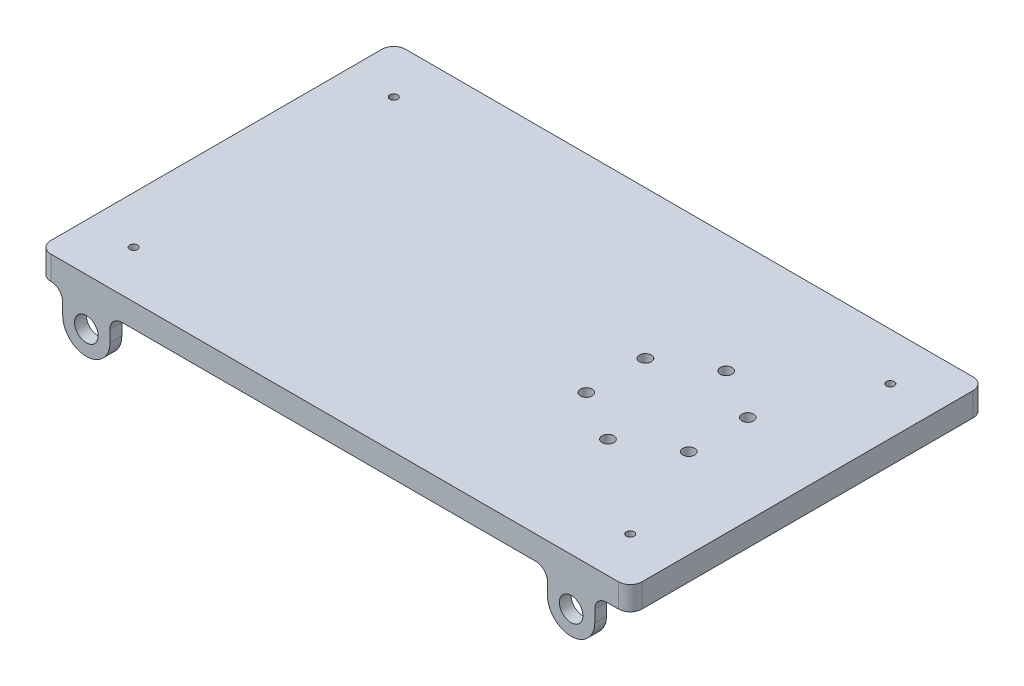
ISO-10303-21;
HEADER;
FILE_DESCRIPTION(('STEP AP214'),'2;1');
FILE_NAME('part.step','',(''),(''),'','','');
FILE_SCHEMA(('AUTOMOTIVE_DESIGN { 1 0 10303 214 1 1 1 1 }'));
ENDSEC;
DATA;
#1=APPLICATION_CONTEXT('core data for automotive mechanical design processes');
#2=APPLICATION_PROTOCOL_DEFINITION('international standard','automotive_design',2000,#1);
#3=PRODUCT_CONTEXT('',#1,'mechanical');
#4=PRODUCT('Part','Part','',(#3));
#5=PRODUCT_RELATED_PRODUCT_CATEGORY('part','',(#4));
#6=PRODUCT_DEFINITION_FORMATION('','',#4);
#7=PRODUCT_DEFINITION_CONTEXT('part definition',#1,'design');
#8=PRODUCT_DEFINITION('design','',#6,#7);
#9=PRODUCT_DEFINITION_SHAPE('','',#8);
#10=(LENGTH_UNIT() NAMED_UNIT(*) SI_UNIT(.MILLI.,.METRE.));
#11=(NAMED_UNIT(*) PLANE_ANGLE_UNIT() SI_UNIT($,.RADIAN.));
#12=(NAMED_UNIT(*) SI_UNIT($,.STERADIAN.) SOLID_ANGLE_UNIT());
#13=UNCERTAINTY_MEASURE_WITH_UNIT(LENGTH_MEASURE(1.E-05),#10,'distance_accuracy_value','');
#14=(GEOMETRIC_REPRESENTATION_CONTEXT(3) GLOBAL_UNCERTAINTY_ASSIGNED_CONTEXT((#13)) GLOBAL_UNIT_ASSIGNED_CONTEXT((#10,
#11,#12)) REPRESENTATION_CONTEXT('',''));
#15=CARTESIAN_POINT('',(0.,0.,0.));
#16=DIRECTION('',(0.,0.,1.));
#17=DIRECTION('',(1.,0.,0.));
#18=AXIS2_PLACEMENT_3D('',#15,#16,#17);
#19=CARTESIAN_POINT('',(0.,20.,0.));
#20=DIRECTION('',(0.,1.,0.));
#21=DIRECTION('',(0.,0.,1.));
#22=AXIS2_PLACEMENT_3D('',#19,#20,#21);
#23=PLANE('',#22);
#24=CARTESIAN_POINT('',(-210.,20.,-110.));
#25=DIRECTION('',(0.,1.,0.));
#26=DIRECTION('',(0.,0.,1.));
#27=AXIS2_PLACEMENT_3D('',#24,#25,#26);
#28=CIRCLE('',#27,3.3);
#29=CARTESIAN_POINT('',(-210.,20.,-106.7));
#30=VERTEX_POINT('',#29);
#31=EDGE_CURVE('E540',#30,#30,#28,.T.);
#32=ORIENTED_EDGE('',*,*,#31,.F.);
#33=EDGE_LOOP('',(#32));
#34=FACE_BOUND('',#33,.T.);
#35=CARTESIAN_POINT('',(210.,20.,110.));
#36=DIRECTION('',(0.,1.,0.));
#37=DIRECTION('',(0.,0.,1.));
#38=AXIS2_PLACEMENT_3D('',#35,#36,#37);
#39=CIRCLE('',#38,3.3);
#40=CARTESIAN_POINT('',(210.,20.,113.3));
#41=VERTEX_POINT('',#40);
#42=EDGE_CURVE('E529',#41,#41,#39,.T.);
#43=ORIENTED_EDGE('',*,*,#42,.F.);
#44=EDGE_LOOP('',(#43));
#45=FACE_BOUND('',#44,.T.);
#46=CARTESIAN_POINT('',(210.,20.,-110.));
#47=DIRECTION('',(0.,1.,0.));
#48=DIRECTION('',(0.,0.,1.));
#49=AXIS2_PLACEMENT_3D('',#46,#47,#48);
#50=CIRCLE('',#49,3.3);
#51=CARTESIAN_POINT('',(210.,20.,-106.7));
#52=VERTEX_POINT('',#51);
#53=EDGE_CURVE('E526',#52,#52,#50,.T.);
#54=ORIENTED_EDGE('',*,*,#53,.F.);
#55=EDGE_LOOP('',(#54));
#56=FACE_BOUND('',#55,.T.);
#57=CARTESIAN_POINT('',(-210.,20.,110.));
#58=DIRECTION('',(0.,1.,0.));
#59=DIRECTION('',(0.,0.,1.));
#60=AXIS2_PLACEMENT_3D('',#57,#58,#59);
#61=CIRCLE('',#60,3.3);
#62=CARTESIAN_POINT('',(-210.,20.,113.3));
#63=VERTEX_POINT('',#62);
#64=EDGE_CURVE('E523',#63,#63,#61,.T.);
#65=ORIENTED_EDGE('',*,*,#64,.F.);
#66=EDGE_LOOP('',(#65));
#67=FACE_BOUND('',#66,.T.);
#68=CARTESIAN_POINT('',(131.146323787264,20.,-50.));
#69=DIRECTION('',(0.,1.,0.));
#70=DIRECTION('',(0.,0.,1.));
#71=AXIS2_PLACEMENT_3D('',#68,#69,#70);
#72=CIRCLE('',#71,4.99999999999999);
#73=CARTESIAN_POINT('',(131.146323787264,20.,-45.));
#74=VERTEX_POINT('',#73);
#75=EDGE_CURVE('E544',#74,#74,#72,.T.);
#76=ORIENTED_EDGE('',*,*,#75,.F.);
#77=EDGE_LOOP('',(#76));
#78=FACE_BOUND('',#77,.T.);
#79=CARTESIAN_POINT('',(87.8450535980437,20.,-24.9999999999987));
#80=DIRECTION('',(0.,1.,0.));
#81=DIRECTION('',(0.,0.,1.));
#82=AXIS2_PLACEMENT_3D('',#79,#80,#81);
#83=CIRCLE('',#82,4.99999999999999);
#84=CARTESIAN_POINT('',(87.8450535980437,20.,-19.9999999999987));
#85=VERTEX_POINT('',#84);
#86=EDGE_CURVE('E543',#85,#85,#83,.T.);
#87=ORIENTED_EDGE('',*,*,#86,.F.);
#88=EDGE_LOOP('',(#87));
#89=FACE_BOUND('',#88,.T.);
#90=CARTESIAN_POINT('',(87.8450535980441,20.,24.9999999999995));
#91=DIRECTION('',(0.,1.,0.));
#92=DIRECTION('',(0.,0.,1.));
#93=AXIS2_PLACEMENT_3D('',#90,#91,#92);
#94=CIRCLE('',#93,4.9999999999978);
#95=CARTESIAN_POINT('',(87.8450535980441,20.,29.9999999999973));
#96=VERTEX_POINT('',#95);
#97=EDGE_CURVE('E551',#96,#96,#94,.T.);
#98=ORIENTED_EDGE('',*,*,#97,.F.);
#99=EDGE_LOOP('',(#98));
#100=FACE_BOUND('',#99,.T.);
#101=CARTESIAN_POINT('',(131.146323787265,20.,49.9999999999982));
#102=DIRECTION('',(0.,1.,0.));
#103=DIRECTION('',(0.,0.,1.));
#104=AXIS2_PLACEMENT_3D('',#101,#102,#103);
#105=CIRCLE('',#104,4.99999999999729);
#106=CARTESIAN_POINT('',(131.146323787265,20.,54.9999999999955));
#107=VERTEX_POINT('',#106);
#108=EDGE_CURVE('E557',#107,#107,#105,.T.);
#109=ORIENTED_EDGE('',*,*,#108,.F.);
#110=EDGE_LOOP('',(#109));
#111=FACE_BOUND('',#110,.T.);
#112=CARTESIAN_POINT('',(174.447593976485,20.,24.9999999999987));
#113=DIRECTION('',(0.,1.,0.));
#114=DIRECTION('',(0.,0.,1.));
#115=AXIS2_PLACEMENT_3D('',#112,#113,#114);
#116=CIRCLE('',#115,4.9999999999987);
#117=CARTESIAN_POINT('',(174.447593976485,20.,29.9999999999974));
#118=VERTEX_POINT('',#117);
#119=EDGE_CURVE('E554',#118,#118,#116,.T.);
#120=ORIENTED_EDGE('',*,*,#119,.F.);
#121=EDGE_LOOP('',(#120));
#122=FACE_BOUND('',#121,.T.);
#123=CARTESIAN_POINT('',(174.447593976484,20.,-24.9999999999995));
#124=DIRECTION('',(0.,1.,0.));
#125=DIRECTION('',(0.,0.,1.));
#126=AXIS2_PLACEMENT_3D('',#123,#124,#125);
#127=CIRCLE('',#126,5.00000000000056);
#128=CARTESIAN_POINT('',(174.447593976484,20.,-19.9999999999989));
#129=VERTEX_POINT('',#128);
#130=EDGE_CURVE('E548',#129,#129,#127,.T.);
#131=ORIENTED_EDGE('',*,*,#130,.F.);
#132=EDGE_LOOP('',(#131));
#133=FACE_BOUND('',#132,.T.);
#134=DIRECTION('',(0.,0.,1.));
#135=VECTOR('',#134,1.);
#136=CARTESIAN_POINT('',(-250.,20.,150.));
#137=LINE('',#136,#135);
#138=CARTESIAN_POINT('',(-250.,20.,-140.));
#139=VERTEX_POINT('',#138);
#140=CARTESIAN_POINT('',(-250.,20.,140.));
#141=VERTEX_POINT('',#140);
#142=EDGE_CURVE('E388',#139,#141,#137,.T.);
#143=ORIENTED_EDGE('',*,*,#142,.T.);
#144=CARTESIAN_POINT('',(-240.,20.,140.));
#145=DIRECTION('',(0.,1.,0.));
#146=DIRECTION('',(0.,0.,1.));
#147=AXIS2_PLACEMENT_3D('',#144,#145,#146);
#148=CIRCLE('',#147,10.);
#149=CARTESIAN_POINT('',(-240.,20.,150.));
#150=VERTEX_POINT('',#149);
#151=EDGE_CURVE('E437',#141,#150,#148,.T.);
#152=ORIENTED_EDGE('',*,*,#151,.T.);
#153=DIRECTION('',(1.,0.,0.));
#154=VECTOR('',#153,1.);
#155=CARTESIAN_POINT('',(250.,20.,150.));
#156=LINE('',#155,#154);
#157=CARTESIAN_POINT('',(240.,20.,150.));
#158=VERTEX_POINT('',#157);
#159=EDGE_CURVE('E391',#150,#158,#156,.T.);
#160=ORIENTED_EDGE('',*,*,#159,.T.);
#161=CARTESIAN_POINT('',(240.,20.,140.));
#162=DIRECTION('',(0.,1.,0.));
#163=DIRECTION('',(0.,0.,1.));
#164=AXIS2_PLACEMENT_3D('',#161,#162,#163);
#165=CIRCLE('',#164,10.);
#166=CARTESIAN_POINT('',(250.,20.,140.));
#167=VERTEX_POINT('',#166);
#168=EDGE_CURVE('E431',#158,#167,#165,.T.);
#169=ORIENTED_EDGE('',*,*,#168,.T.);
#170=DIRECTION('',(0.,0.,-1.));
#171=VECTOR('',#170,1.);
#172=CARTESIAN_POINT('',(250.,20.,150.));
#173=LINE('',#172,#171);
#174=CARTESIAN_POINT('',(250.,20.,-140.));
#175=VERTEX_POINT('',#174);
#176=EDGE_CURVE('E395',#167,#175,#173,.T.);
#177=ORIENTED_EDGE('',*,*,#176,.T.);
#178=CARTESIAN_POINT('',(240.,20.,-140.));
#179=DIRECTION('',(0.,1.,0.));
#180=DIRECTION('',(0.,0.,1.));
#181=AXIS2_PLACEMENT_3D('',#178,#179,#180);
#182=CIRCLE('',#181,10.);
#183=CARTESIAN_POINT('',(240.,20.,-150.));
#184=VERTEX_POINT('',#183);
#185=EDGE_CURVE('E433',#175,#184,#182,.T.);
#186=ORIENTED_EDGE('',*,*,#185,.T.);
#187=DIRECTION('',(-1.,0.,0.));
#188=VECTOR('',#187,1.);
#189=CARTESIAN_POINT('',(250.,20.,-150.));
#190=LINE('',#189,#188);
#191=CARTESIAN_POINT('',(-240.,20.,-150.));
#192=VERTEX_POINT('',#191);
#193=EDGE_CURVE('E398',#184,#192,#190,.T.);
#194=ORIENTED_EDGE('',*,*,#193,.T.);
#195=CARTESIAN_POINT('',(-240.,20.,-140.));
#196=DIRECTION('',(0.,1.,0.));
#197=DIRECTION('',(0.,0.,1.));
#198=AXIS2_PLACEMENT_3D('',#195,#196,#197);
#199=CIRCLE('',#198,10.);
#200=EDGE_CURVE('E435',#192,#139,#199,.T.);
#201=ORIENTED_EDGE('',*,*,#200,.T.);
#202=EDGE_LOOP('',(#143,#152,#160,#169,#177,#186,#194,#201));
#203=FACE_BOUND('',#202,.T.);
#204=ADVANCED_FACE('F47',(#34,#45,#56,#67,#78,#89,#100,#111,#122,#133,#203),#23,.T.);
#205=CARTESIAN_POINT('',(0.,0.,0.));
#206=DIRECTION('',(0.,1.,0.));
#207=DIRECTION('',(0.,0.,1.));
#208=AXIS2_PLACEMENT_3D('',#205,#206,#207);
#209=PLANE('',#208);
#210=CARTESIAN_POINT('',(-210.,0.,-110.));
#211=DIRECTION('',(0.,1.,0.));
#212=DIRECTION('',(0.,0.,1.));
#213=AXIS2_PLACEMENT_3D('',#210,#211,#212);
#214=CIRCLE('',#213,3.3);
#215=CARTESIAN_POINT('',(-210.,0.,-106.7));
#216=VERTEX_POINT('',#215);
#217=EDGE_CURVE('E51',#216,#216,#214,.T.);
#218=ORIENTED_EDGE('',*,*,#217,.T.);
#219=EDGE_LOOP('',(#218));
#220=FACE_BOUND('',#219,.T.);
#221=CARTESIAN_POINT('',(210.,0.,110.));
#222=DIRECTION('',(0.,1.,0.));
#223=DIRECTION('',(0.,0.,1.));
#224=AXIS2_PLACEMENT_3D('',#221,#222,#223);
#225=CIRCLE('',#224,3.3);
#226=CARTESIAN_POINT('',(210.,0.,113.3));
#227=VERTEX_POINT('',#226);
#228=EDGE_CURVE('E527',#227,#227,#225,.T.);
#229=ORIENTED_EDGE('',*,*,#228,.T.);
#230=EDGE_LOOP('',(#229));
#231=FACE_BOUND('',#230,.T.);
#232=CARTESIAN_POINT('',(210.,0.,-110.));
#233=DIRECTION('',(0.,1.,0.));
#234=DIRECTION('',(0.,0.,1.));
#235=AXIS2_PLACEMENT_3D('',#232,#233,#234);
#236=CIRCLE('',#235,3.3);
#237=CARTESIAN_POINT('',(210.,0.,-106.7));
#238=VERTEX_POINT('',#237);
#239=EDGE_CURVE('E524',#238,#238,#236,.T.);
#240=ORIENTED_EDGE('',*,*,#239,.T.);
#241=EDGE_LOOP('',(#240));
#242=FACE_BOUND('',#241,.T.);
#243=CARTESIAN_POINT('',(-210.,0.,110.));
#244=DIRECTION('',(0.,1.,0.));
#245=DIRECTION('',(0.,0.,1.));
#246=AXIS2_PLACEMENT_3D('',#243,#244,#245);
#247=CIRCLE('',#246,3.3);
#248=CARTESIAN_POINT('',(-210.,0.,113.3));
#249=VERTEX_POINT('',#248);
#250=EDGE_CURVE('E520',#249,#249,#247,.T.);
#251=ORIENTED_EDGE('',*,*,#250,.T.);
#252=EDGE_LOOP('',(#251));
#253=FACE_BOUND('',#252,.T.);
#254=CARTESIAN_POINT('',(131.146323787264,0.,-50.));
#255=DIRECTION('',(0.,1.,0.));
#256=DIRECTION('',(0.,0.,1.));
#257=AXIS2_PLACEMENT_3D('',#254,#255,#256);
#258=CIRCLE('',#257,4.99999999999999);
#259=CARTESIAN_POINT('',(131.146323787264,0.,-45.));
#260=VERTEX_POINT('',#259);
#261=EDGE_CURVE('E287',#260,#260,#258,.T.);
#262=ORIENTED_EDGE('',*,*,#261,.T.);
#263=EDGE_LOOP('',(#262));
#264=FACE_BOUND('',#263,.T.);
#265=CARTESIAN_POINT('',(87.8450535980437,0.,-24.9999999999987));
#266=DIRECTION('',(0.,1.,0.));
#267=DIRECTION('',(0.,0.,1.));
#268=AXIS2_PLACEMENT_3D('',#265,#266,#267);
#269=CIRCLE('',#268,4.99999999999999);
#270=CARTESIAN_POINT('',(87.8450535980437,0.,-19.9999999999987));
#271=VERTEX_POINT('',#270);
#272=EDGE_CURVE('E572',#271,#271,#269,.T.);
#273=ORIENTED_EDGE('',*,*,#272,.T.);
#274=EDGE_LOOP('',(#273));
#275=FACE_BOUND('',#274,.T.);
#276=CARTESIAN_POINT('',(87.8450535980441,0.,24.9999999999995));
#277=DIRECTION('',(0.,1.,0.));
#278=DIRECTION('',(0.,0.,1.));
#279=AXIS2_PLACEMENT_3D('',#276,#277,#278);
#280=CIRCLE('',#279,4.9999999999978);
#281=CARTESIAN_POINT('',(87.8450535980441,0.,29.9999999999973));
#282=VERTEX_POINT('',#281);
#283=EDGE_CURVE('E570',#282,#282,#280,.T.);
#284=ORIENTED_EDGE('',*,*,#283,.T.);
#285=EDGE_LOOP('',(#284));
#286=FACE_BOUND('',#285,.T.);
#287=CARTESIAN_POINT('',(131.146323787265,0.,49.9999999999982));
#288=DIRECTION('',(0.,1.,0.));
#289=DIRECTION('',(0.,0.,1.));
#290=AXIS2_PLACEMENT_3D('',#287,#288,#289);
#291=CIRCLE('',#290,4.99999999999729);
#292=CARTESIAN_POINT('',(131.146323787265,0.,54.9999999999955));
#293=VERTEX_POINT('',#292);
#294=EDGE_CURVE('E567',#293,#293,#291,.T.);
#295=ORIENTED_EDGE('',*,*,#294,.T.);
#296=EDGE_LOOP('',(#295));
#297=FACE_BOUND('',#296,.T.);
#298=CARTESIAN_POINT('',(174.447593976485,0.,24.9999999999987));
#299=DIRECTION('',(0.,1.,0.));
#300=DIRECTION('',(0.,0.,1.));
#301=AXIS2_PLACEMENT_3D('',#298,#299,#300);
#302=CIRCLE('',#301,4.9999999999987);
#303=CARTESIAN_POINT('',(174.447593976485,0.,29.9999999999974));
#304=VERTEX_POINT('',#303);
#305=EDGE_CURVE('E564',#304,#304,#302,.T.);
#306=ORIENTED_EDGE('',*,*,#305,.T.);
#307=EDGE_LOOP('',(#306));
#308=FACE_BOUND('',#307,.T.);
#309=CARTESIAN_POINT('',(174.447593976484,0.,-24.9999999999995));
#310=DIRECTION('',(0.,1.,0.));
#311=DIRECTION('',(0.,0.,1.));
#312=AXIS2_PLACEMENT_3D('',#309,#310,#311);
#313=CIRCLE('',#312,5.00000000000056);
#314=CARTESIAN_POINT('',(174.447593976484,0.,-19.9999999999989));
#315=VERTEX_POINT('',#314);
#316=EDGE_CURVE('E547',#315,#315,#313,.T.);
#317=ORIENTED_EDGE('',*,*,#316,.T.);
#318=EDGE_LOOP('',(#317));
#319=FACE_BOUND('',#318,.T.);
#320=DIRECTION('',(1.,0.,0.));
#321=VECTOR('',#320,1.);
#322=CARTESIAN_POINT('',(0.,0.,-140.));
#323=LINE('',#322,#321);
#324=CARTESIAN_POINT('',(170.,0.,-140.));
#325=VERTEX_POINT('',#324);
#326=CARTESIAN_POINT('',(230.,0.,-140.));
#327=VERTEX_POINT('',#326);
#328=EDGE_CURVE('E348',#325,#327,#323,.T.);
#329=ORIENTED_EDGE('',*,*,#328,.T.);
#330=DIRECTION('',(0.,0.,1.));
#331=VECTOR('',#330,1.);
#332=CARTESIAN_POINT('',(230.,0.,0.));
#333=LINE('',#332,#331);
#334=CARTESIAN_POINT('',(230.,0.,-150.));
#335=VERTEX_POINT('',#334);
#336=EDGE_CURVE('E486',#327,#335,#333,.F.);
#337=ORIENTED_EDGE('',*,*,#336,.T.);
#338=DIRECTION('',(-1.,0.,0.));
#339=VECTOR('',#338,1.);
#340=CARTESIAN_POINT('',(250.,0.,-150.));
#341=LINE('',#340,#339);
#342=CARTESIAN_POINT('',(240.,0.,-150.));
#343=VERTEX_POINT('',#342);
#344=EDGE_CURVE('E392',#343,#335,#341,.T.);
#345=ORIENTED_EDGE('',*,*,#344,.F.);
#346=CARTESIAN_POINT('',(240.,0.,-140.));
#347=DIRECTION('',(0.,1.,0.));
#348=DIRECTION('',(0.,0.,1.));
#349=AXIS2_PLACEMENT_3D('',#346,#347,#348);
#350=CIRCLE('',#349,10.);
#351=CARTESIAN_POINT('',(250.,0.,-140.));
#352=VERTEX_POINT('',#351);
#353=EDGE_CURVE('E419',#343,#352,#350,.F.);
#354=ORIENTED_EDGE('',*,*,#353,.T.);
#355=DIRECTION('',(0.,0.,-1.));
#356=VECTOR('',#355,1.);
#357=CARTESIAN_POINT('',(250.,0.,150.));
#358=LINE('',#357,#356);
#359=CARTESIAN_POINT('',(250.,0.,140.));
#360=VERTEX_POINT('',#359);
#361=EDGE_CURVE('E407',#360,#352,#358,.T.);
#362=ORIENTED_EDGE('',*,*,#361,.F.);
#363=CARTESIAN_POINT('',(240.,0.,140.));
#364=DIRECTION('',(0.,1.,0.));
#365=DIRECTION('',(0.,0.,1.));
#366=AXIS2_PLACEMENT_3D('',#363,#364,#365);
#367=CIRCLE('',#366,10.);
#368=CARTESIAN_POINT('',(240.,0.,150.));
#369=VERTEX_POINT('',#368);
#370=EDGE_CURVE('E416',#360,#369,#367,.F.);
#371=ORIENTED_EDGE('',*,*,#370,.T.);
#372=DIRECTION('',(1.,0.,0.));
#373=VECTOR('',#372,1.);
#374=CARTESIAN_POINT('',(250.,0.,150.));
#375=LINE('',#374,#373);
#376=CARTESIAN_POINT('',(230.,0.,150.));
#377=VERTEX_POINT('',#376);
#378=EDGE_CURVE('E404',#377,#369,#375,.T.);
#379=ORIENTED_EDGE('',*,*,#378,.F.);
#380=DIRECTION('',(0.,0.,1.));
#381=VECTOR('',#380,1.);
#382=CARTESIAN_POINT('',(230.,0.,0.));
#383=LINE('',#382,#381);
#384=CARTESIAN_POINT('',(230.,0.,140.));
#385=VERTEX_POINT('',#384);
#386=EDGE_CURVE('E449',#377,#385,#383,.F.);
#387=ORIENTED_EDGE('',*,*,#386,.T.);
#388=DIRECTION('',(1.,0.,0.));
#389=VECTOR('',#388,1.);
#390=CARTESIAN_POINT('',(0.,0.,140.));
#391=LINE('',#390,#389);
#392=CARTESIAN_POINT('',(170.,0.,140.));
#393=VERTEX_POINT('',#392);
#394=EDGE_CURVE('E366',#393,#385,#391,.T.);
#395=ORIENTED_EDGE('',*,*,#394,.F.);
#396=DIRECTION('',(0.,0.,1.));
#397=VECTOR('',#396,1.);
#398=CARTESIAN_POINT('',(170.,0.,0.));
#399=LINE('',#398,#397);
#400=CARTESIAN_POINT('',(170.,0.,150.));
#401=VERTEX_POINT('',#400);
#402=EDGE_CURVE('E452',#393,#401,#399,.T.);
#403=ORIENTED_EDGE('',*,*,#402,.T.);
#404=CARTESIAN_POINT('',(-180.,0.,150.));
#405=VERTEX_POINT('',#404);
#406=EDGE_CURVE('E405',#405,#401,#375,.T.);
#407=ORIENTED_EDGE('',*,*,#406,.F.);
#408=DIRECTION('',(0.,0.,1.));
#409=VECTOR('',#408,1.);
#410=CARTESIAN_POINT('',(-180.,0.,0.));
#411=LINE('',#410,#409);
#412=CARTESIAN_POINT('',(-180.,0.,140.));
#413=VERTEX_POINT('',#412);
#414=EDGE_CURVE('E475',#405,#413,#411,.F.);
#415=ORIENTED_EDGE('',*,*,#414,.T.);
#416=DIRECTION('',(1.,0.,0.));
#417=VECTOR('',#416,1.);
#418=CARTESIAN_POINT('',(-410.,0.,140.));
#419=LINE('',#418,#417);
#420=CARTESIAN_POINT('',(-240.,0.,140.));
#421=VERTEX_POINT('',#420);
#422=EDGE_CURVE('E308',#421,#413,#419,.T.);
#423=ORIENTED_EDGE('',*,*,#422,.F.);
#424=DIRECTION('',(0.,0.,1.));
#425=VECTOR('',#424,1.);
#426=CARTESIAN_POINT('',(-240.,0.,0.));
#427=LINE('',#426,#425);
#428=CARTESIAN_POINT('',(-240.,0.,150.));
#429=VERTEX_POINT('',#428);
#430=EDGE_CURVE('E472',#421,#429,#427,.T.);
#431=ORIENTED_EDGE('',*,*,#430,.T.);
#432=CARTESIAN_POINT('',(-240.,0.,140.));
#433=DIRECTION('',(0.,1.,0.));
#434=DIRECTION('',(0.,0.,1.));
#435=AXIS2_PLACEMENT_3D('',#432,#433,#434);
#436=CIRCLE('',#435,10.);
#437=CARTESIAN_POINT('',(-250.,0.,140.));
#438=VERTEX_POINT('',#437);
#439=EDGE_CURVE('E424',#429,#438,#436,.F.);
#440=ORIENTED_EDGE('',*,*,#439,.T.);
#441=DIRECTION('',(0.,0.,1.));
#442=VECTOR('',#441,1.);
#443=CARTESIAN_POINT('',(-250.,0.,150.));
#444=LINE('',#443,#442);
#445=CARTESIAN_POINT('',(-250.,0.,-140.));
#446=VERTEX_POINT('',#445);
#447=EDGE_CURVE('E386',#446,#438,#444,.T.);
#448=ORIENTED_EDGE('',*,*,#447,.F.);
#449=CARTESIAN_POINT('',(-240.,0.,-140.));
#450=DIRECTION('',(0.,1.,0.));
#451=DIRECTION('',(0.,0.,1.));
#452=AXIS2_PLACEMENT_3D('',#449,#450,#451);
#453=CIRCLE('',#452,10.);
#454=CARTESIAN_POINT('',(-240.,0.,-150.));
#455=VERTEX_POINT('',#454);
#456=EDGE_CURVE('E421',#446,#455,#453,.F.);
#457=ORIENTED_EDGE('',*,*,#456,.T.);
#458=DIRECTION('',(0.,0.,1.));
#459=VECTOR('',#458,1.);
#460=CARTESIAN_POINT('',(-240.,0.,0.));
#461=LINE('',#460,#459);
#462=CARTESIAN_POINT('',(-240.,0.,-140.));
#463=VERTEX_POINT('',#462);
#464=EDGE_CURVE('E480',#455,#463,#461,.T.);
#465=ORIENTED_EDGE('',*,*,#464,.T.);
#466=DIRECTION('',(1.,0.,0.));
#467=VECTOR('',#466,1.);
#468=CARTESIAN_POINT('',(-410.,0.,-140.));
#469=LINE('',#468,#467);
#470=CARTESIAN_POINT('',(-180.,0.,-140.));
#471=VERTEX_POINT('',#470);
#472=EDGE_CURVE('E296',#463,#471,#469,.T.);
#473=ORIENTED_EDGE('',*,*,#472,.T.);
#474=DIRECTION('',(0.,0.,1.));
#475=VECTOR('',#474,1.);
#476=CARTESIAN_POINT('',(-180.,0.,0.));
#477=LINE('',#476,#475);
#478=CARTESIAN_POINT('',(-180.,0.,-150.));
#479=VERTEX_POINT('',#478);
#480=EDGE_CURVE('E478',#471,#479,#477,.F.);
#481=ORIENTED_EDGE('',*,*,#480,.T.);
#482=CARTESIAN_POINT('',(170.,0.,-150.));
#483=VERTEX_POINT('',#482);
#484=EDGE_CURVE('E410',#483,#479,#341,.T.);
#485=ORIENTED_EDGE('',*,*,#484,.F.);
#486=DIRECTION('',(0.,0.,1.));
#487=VECTOR('',#486,1.);
#488=CARTESIAN_POINT('',(170.,0.,0.));
#489=LINE('',#488,#487);
#490=EDGE_CURVE('E483',#483,#325,#489,.T.);
#491=ORIENTED_EDGE('',*,*,#490,.T.);
#492=EDGE_LOOP('',(#329,#337,#345,#354,#362,#371,#379,#387,#395,#403,#407,#415,#423,#431,#440,
#448,#457,#465,#473,#481,#485,#491));
#493=FACE_BOUND('',#492,.T.);
#494=ADVANCED_FACE('F579',(#220,#231,#242,#253,#264,#275,#286,#297,#308,#319,#493),#209,.F.);
#495=CARTESIAN_POINT('',(-250.,20.,150.));
#496=DIRECTION('',(1.,0.,0.));
#497=DIRECTION('',(0.,0.,-1.));
#498=AXIS2_PLACEMENT_3D('',#495,#496,#497);
#499=PLANE('',#498);
#500=ORIENTED_EDGE('',*,*,#447,.T.);
#501=DIRECTION('',(0.,-1.,0.));
#502=VECTOR('',#501,1.);
#503=CARTESIAN_POINT('',(-250.,20.,140.));
#504=LINE('',#503,#502);
#505=EDGE_CURVE('E429',#438,#141,#504,.F.);
#506=ORIENTED_EDGE('',*,*,#505,.T.);
#507=ORIENTED_EDGE('',*,*,#142,.F.);
#508=DIRECTION('',(0.,-1.,0.));
#509=VECTOR('',#508,1.);
#510=CARTESIAN_POINT('',(-250.,20.,-140.));
#511=LINE('',#510,#509);
#512=EDGE_CURVE('E426',#139,#446,#511,.T.);
#513=ORIENTED_EDGE('',*,*,#512,.T.);
#514=EDGE_LOOP('',(#500,#506,#507,#513));
#515=FACE_BOUND('',#514,.T.);
#516=ADVANCED_FACE('F603',(#515),#499,.F.);
#517=CARTESIAN_POINT('',(250.,20.,150.));
#518=DIRECTION('',(0.,0.,-1.));
#519=DIRECTION('',(-1.,0.,0.));
#520=AXIS2_PLACEMENT_3D('',#517,#518,#519);
#521=PLANE('',#520);
#522=ORIENTED_EDGE('',*,*,#159,.F.);
#523=DIRECTION('',(0.,-1.,0.));
#524=VECTOR('',#523,1.);
#525=CARTESIAN_POINT('',(-240.,20.,150.));
#526=LINE('',#525,#524);
#527=EDGE_CURVE('E414',#150,#429,#526,.T.);
#528=ORIENTED_EDGE('',*,*,#527,.T.);
#529=CARTESIAN_POINT('',(-240.,-10.,150.));
#530=DIRECTION('',(0.,0.,-1.));
#531=DIRECTION('',(-1.,0.,0.));
#532=AXIS2_PLACEMENT_3D('',#529,#530,#531);
#533=CIRCLE('',#532,10.);
#534=CARTESIAN_POINT('',(-230.,-9.99999999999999,150.));
#535=VERTEX_POINT('',#534);
#536=EDGE_CURVE('E56',#429,#535,#533,.T.);
#537=ORIENTED_EDGE('',*,*,#536,.T.);
#538=DIRECTION('',(0.,-1.,0.));
#539=VECTOR('',#538,1.);
#540=CARTESIAN_POINT('',(-230.,2.5012665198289E-13,150.));
#541=LINE('',#540,#539);
#542=CARTESIAN_POINT('',(-230.,-19.9738955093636,150.));
#543=VERTEX_POINT('',#542);
#544=EDGE_CURVE('E321',#535,#543,#541,.T.);
#545=ORIENTED_EDGE('',*,*,#544,.T.);
#546=CARTESIAN_POINT('',(-210.,-19.9738955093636,150.));
#547=DIRECTION('',(0.,0.,1.));
#548=DIRECTION('',(1.,0.,0.));
#549=AXIS2_PLACEMENT_3D('',#546,#547,#548);
#550=CIRCLE('',#549,20.);
#551=CARTESIAN_POINT('',(-190.,-19.9738955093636,150.));
#552=VERTEX_POINT('',#551);
#553=EDGE_CURVE('E299',#543,#552,#550,.T.);
#554=ORIENTED_EDGE('',*,*,#553,.T.);
#555=DIRECTION('',(0.,1.,0.));
#556=VECTOR('',#555,1.);
#557=CARTESIAN_POINT('',(-190.,0.,150.));
#558=LINE('',#557,#556);
#559=CARTESIAN_POINT('',(-190.,-10.,150.));
#560=VERTEX_POINT('',#559);
#561=EDGE_CURVE('E318',#552,#560,#558,.T.);
#562=ORIENTED_EDGE('',*,*,#561,.T.);
#563=CARTESIAN_POINT('',(-180.,-10.,150.));
#564=DIRECTION('',(0.,0.,-1.));
#565=DIRECTION('',(-1.,0.,0.));
#566=AXIS2_PLACEMENT_3D('',#563,#564,#565);
#567=CIRCLE('',#566,10.);
#568=EDGE_CURVE('E515',#560,#405,#567,.T.);
#569=ORIENTED_EDGE('',*,*,#568,.T.);
#570=ORIENTED_EDGE('',*,*,#406,.T.);
#571=CARTESIAN_POINT('',(170.,-10.,150.));
#572=DIRECTION('',(0.,0.,-1.));
#573=DIRECTION('',(-1.,0.,0.));
#574=AXIS2_PLACEMENT_3D('',#571,#572,#573);
#575=CIRCLE('',#574,10.);
#576=CARTESIAN_POINT('',(180.,-9.99999999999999,150.));
#577=VERTEX_POINT('',#576);
#578=EDGE_CURVE('E460',#401,#577,#575,.T.);
#579=ORIENTED_EDGE('',*,*,#578,.T.);
#580=DIRECTION('',(0.,-1.,0.));
#581=VECTOR('',#580,1.);
#582=CARTESIAN_POINT('',(180.,2.5012665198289E-13,150.));
#583=LINE('',#582,#581);
#584=CARTESIAN_POINT('',(180.,-19.9738955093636,150.));
#585=VERTEX_POINT('',#584);
#586=EDGE_CURVE('E379',#577,#585,#583,.T.);
#587=ORIENTED_EDGE('',*,*,#586,.T.);
#588=CARTESIAN_POINT('',(200.,-19.9738955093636,150.));
#589=DIRECTION('',(0.,0.,1.));
#590=DIRECTION('',(1.,0.,0.));
#591=AXIS2_PLACEMENT_3D('',#588,#589,#590);
#592=CIRCLE('',#591,20.);
#593=CARTESIAN_POINT('',(220.,-19.9738955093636,150.));
#594=VERTEX_POINT('',#593);
#595=EDGE_CURVE('E357',#585,#594,#592,.T.);
#596=ORIENTED_EDGE('',*,*,#595,.T.);
#597=DIRECTION('',(0.,1.,0.));
#598=VECTOR('',#597,1.);
#599=CARTESIAN_POINT('',(220.,0.,150.));
#600=LINE('',#599,#598);
#601=CARTESIAN_POINT('',(220.,-10.,150.));
#602=VERTEX_POINT('',#601);
#603=EDGE_CURVE('E376',#594,#602,#600,.T.);
#604=ORIENTED_EDGE('',*,*,#603,.T.);
#605=CARTESIAN_POINT('',(230.,-10.,150.));
#606=DIRECTION('',(0.,0.,-1.));
#607=DIRECTION('',(-1.,0.,0.));
#608=AXIS2_PLACEMENT_3D('',#605,#606,#607);
#609=CIRCLE('',#608,10.);
#610=EDGE_CURVE('E465',#602,#377,#609,.T.);
#611=ORIENTED_EDGE('',*,*,#610,.T.);
#612=ORIENTED_EDGE('',*,*,#378,.T.);
#613=DIRECTION('',(0.,-1.,0.));
#614=VECTOR('',#613,1.);
#615=CARTESIAN_POINT('',(240.,20.,150.));
#616=LINE('',#615,#614);
#617=EDGE_CURVE('E401',#369,#158,#616,.F.);
#618=ORIENTED_EDGE('',*,*,#617,.T.);
#619=EDGE_LOOP('',(#522,#528,#537,#545,#554,#562,#569,#570,#579,#587,#596,#604,#611,#612,#618));
#620=FACE_BOUND('',#619,.T.);
#621=CARTESIAN_POINT('',(200.,-19.9738955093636,150.));
#622=DIRECTION('',(0.,0.,1.));
#623=DIRECTION('',(1.,0.,0.));
#624=AXIS2_PLACEMENT_3D('',#621,#622,#623);
#625=CIRCLE('',#624,10.);
#626=CARTESIAN_POINT('',(210.,-19.9738955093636,150.));
#627=VERTEX_POINT('',#626);
#628=EDGE_CURVE('E363',#627,#627,#625,.T.);
#629=ORIENTED_EDGE('',*,*,#628,.F.);
#630=EDGE_LOOP('',(#629));
#631=FACE_BOUND('',#630,.T.);
#632=CARTESIAN_POINT('',(-210.,-19.9738955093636,150.));
#633=DIRECTION('',(0.,0.,1.));
#634=DIRECTION('',(1.,0.,0.));
#635=AXIS2_PLACEMENT_3D('',#632,#633,#634);
#636=CIRCLE('',#635,10.);
#637=CARTESIAN_POINT('',(-200.,-19.9738955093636,150.));
#638=VERTEX_POINT('',#637);
#639=EDGE_CURVE('E305',#638,#638,#636,.T.);
#640=ORIENTED_EDGE('',*,*,#639,.F.);
#641=EDGE_LOOP('',(#640));
#642=FACE_BOUND('',#641,.T.);
#643=ADVANCED_FACE('F617',(#620,#631,#642),#521,.F.);
#644=CARTESIAN_POINT('',(250.,20.,150.));
#645=DIRECTION('',(-1.,0.,0.));
#646=DIRECTION('',(0.,0.,1.));
#647=AXIS2_PLACEMENT_3D('',#644,#645,#646);
#648=PLANE('',#647);
#649=ORIENTED_EDGE('',*,*,#361,.T.);
#650=DIRECTION('',(0.,-1.,0.));
#651=VECTOR('',#650,1.);
#652=CARTESIAN_POINT('',(250.,20.,-140.));
#653=LINE('',#652,#651);
#654=EDGE_CURVE('E447',#352,#175,#653,.F.);
#655=ORIENTED_EDGE('',*,*,#654,.T.);
#656=ORIENTED_EDGE('',*,*,#176,.F.);
#657=DIRECTION('',(0.,-1.,0.));
#658=VECTOR('',#657,1.);
#659=CARTESIAN_POINT('',(250.,20.,140.));
#660=LINE('',#659,#658);
#661=EDGE_CURVE('E444',#167,#360,#660,.T.);
#662=ORIENTED_EDGE('',*,*,#661,.T.);
#663=EDGE_LOOP('',(#649,#655,#656,#662));
#664=FACE_BOUND('',#663,.T.);
#665=ADVANCED_FACE('F614',(#664),#648,.F.);
#666=CARTESIAN_POINT('',(250.,20.,-150.));
#667=DIRECTION('',(0.,0.,1.));
#668=DIRECTION('',(1.,0.,0.));
#669=AXIS2_PLACEMENT_3D('',#666,#667,#668);
#670=PLANE('',#669);
#671=DIRECTION('',(0.,-1.,0.));
#672=VECTOR('',#671,1.);
#673=CARTESIAN_POINT('',(180.,2.5012665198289E-13,-150.));
#674=LINE('',#673,#672);
#675=CARTESIAN_POINT('',(180.,-9.99999999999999,-150.));
#676=VERTEX_POINT('',#675);
#677=CARTESIAN_POINT('',(180.,-19.9738955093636,-150.));
#678=VERTEX_POINT('',#677);
#679=EDGE_CURVE('E337',#676,#678,#674,.T.);
#680=ORIENTED_EDGE('',*,*,#679,.F.);
#681=CARTESIAN_POINT('',(170.,-10.,-150.));
#682=DIRECTION('',(0.,0.,1.));
#683=DIRECTION('',(1.,0.,0.));
#684=AXIS2_PLACEMENT_3D('',#681,#682,#683);
#685=CIRCLE('',#684,10.);
#686=EDGE_CURVE('E505',#676,#483,#685,.T.);
#687=ORIENTED_EDGE('',*,*,#686,.T.);
#688=ORIENTED_EDGE('',*,*,#484,.T.);
#689=CARTESIAN_POINT('',(-180.,-10.,-150.));
#690=DIRECTION('',(0.,0.,1.));
#691=DIRECTION('',(1.,0.,0.));
#692=AXIS2_PLACEMENT_3D('',#689,#690,#691);
#693=CIRCLE('',#692,10.);
#694=CARTESIAN_POINT('',(-190.,-10.,-150.));
#695=VERTEX_POINT('',#694);
#696=EDGE_CURVE('E275',#479,#695,#693,.T.);
#697=ORIENTED_EDGE('',*,*,#696,.T.);
#698=DIRECTION('',(0.,1.,0.));
#699=VECTOR('',#698,1.);
#700=CARTESIAN_POINT('',(-190.,0.,-150.));
#701=LINE('',#700,#699);
#702=CARTESIAN_POINT('',(-190.,-19.9738955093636,-150.));
#703=VERTEX_POINT('',#702);
#704=EDGE_CURVE('E255',#703,#695,#701,.T.);
#705=ORIENTED_EDGE('',*,*,#704,.F.);
#706=CARTESIAN_POINT('',(-210.,-19.9738955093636,-150.));
#707=DIRECTION('',(0.,0.,1.));
#708=DIRECTION('',(1.,0.,0.));
#709=AXIS2_PLACEMENT_3D('',#706,#707,#708);
#710=CIRCLE('',#709,20.);
#711=CARTESIAN_POINT('',(-230.,-19.9738955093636,-150.));
#712=VERTEX_POINT('',#711);
#713=EDGE_CURVE('E272',#712,#703,#710,.T.);
#714=ORIENTED_EDGE('',*,*,#713,.F.);
#715=DIRECTION('',(0.,-1.,0.));
#716=VECTOR('',#715,1.);
#717=CARTESIAN_POINT('',(-230.,2.5012665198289E-13,-150.));
#718=LINE('',#717,#716);
#719=CARTESIAN_POINT('',(-230.,-9.99999999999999,-150.));
#720=VERTEX_POINT('',#719);
#721=EDGE_CURVE('E276',#720,#712,#718,.T.);
#722=ORIENTED_EDGE('',*,*,#721,.F.);
#723=CARTESIAN_POINT('',(-240.,-10.,-150.));
#724=DIRECTION('',(0.,0.,1.));
#725=DIRECTION('',(1.,0.,0.));
#726=AXIS2_PLACEMENT_3D('',#723,#724,#725);
#727=CIRCLE('',#726,10.);
#728=EDGE_CURVE('E509',#720,#455,#727,.T.);
#729=ORIENTED_EDGE('',*,*,#728,.T.);
#730=DIRECTION('',(0.,-1.,0.));
#731=VECTOR('',#730,1.);
#732=CARTESIAN_POINT('',(-240.,20.,-150.));
#733=LINE('',#732,#731);
#734=EDGE_CURVE('E442',#455,#192,#733,.F.);
#735=ORIENTED_EDGE('',*,*,#734,.T.);
#736=ORIENTED_EDGE('',*,*,#193,.F.);
#737=DIRECTION('',(0.,-1.,0.));
#738=VECTOR('',#737,1.);
#739=CARTESIAN_POINT('',(240.,20.,-150.));
#740=LINE('',#739,#738);
#741=EDGE_CURVE('E439',#184,#343,#740,.T.);
#742=ORIENTED_EDGE('',*,*,#741,.T.);
#743=ORIENTED_EDGE('',*,*,#344,.T.);
#744=CARTESIAN_POINT('',(230.,-10.,-150.));
#745=DIRECTION('',(0.,0.,1.));
#746=DIRECTION('',(1.,0.,0.));
#747=AXIS2_PLACEMENT_3D('',#744,#745,#746);
#748=CIRCLE('',#747,10.);
#749=CARTESIAN_POINT('',(220.,-10.,-150.));
#750=VERTEX_POINT('',#749);
#751=EDGE_CURVE('E501',#335,#750,#748,.T.);
#752=ORIENTED_EDGE('',*,*,#751,.T.);
#753=DIRECTION('',(0.,1.,0.));
#754=VECTOR('',#753,1.);
#755=CARTESIAN_POINT('',(220.,0.,-150.));
#756=LINE('',#755,#754);
#757=CARTESIAN_POINT('',(220.,-19.9738955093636,-150.));
#758=VERTEX_POINT('',#757);
#759=EDGE_CURVE('E333',#758,#750,#756,.T.);
#760=ORIENTED_EDGE('',*,*,#759,.F.);
#761=CARTESIAN_POINT('',(200.,-19.9738955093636,-150.));
#762=DIRECTION('',(0.,0.,1.));
#763=DIRECTION('',(1.,0.,0.));
#764=AXIS2_PLACEMENT_3D('',#761,#762,#763);
#765=CIRCLE('',#764,20.);
#766=EDGE_CURVE('E330',#678,#758,#765,.T.);
#767=ORIENTED_EDGE('',*,*,#766,.F.);
#768=EDGE_LOOP('',(#680,#687,#688,#697,#705,#714,#722,#729,#735,#736,#742,#743,#752,#760,#767));
#769=FACE_BOUND('',#768,.T.);
#770=CARTESIAN_POINT('',(200.,-19.9738955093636,-150.));
#771=DIRECTION('',(0.,0.,1.));
#772=DIRECTION('',(1.,0.,0.));
#773=AXIS2_PLACEMENT_3D('',#770,#771,#772);
#774=CIRCLE('',#773,10.);
#775=CARTESIAN_POINT('',(210.,-19.9738955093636,-150.));
#776=VERTEX_POINT('',#775);
#777=EDGE_CURVE('E339',#776,#776,#774,.T.);
#778=ORIENTED_EDGE('',*,*,#777,.T.);
#779=EDGE_LOOP('',(#778));
#780=FACE_BOUND('',#779,.T.);
#781=CARTESIAN_POINT('',(-210.,-19.9738955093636,-150.));
#782=DIRECTION('',(0.,0.,1.));
#783=DIRECTION('',(1.,0.,0.));
#784=AXIS2_PLACEMENT_3D('',#781,#782,#783);
#785=CIRCLE('',#784,10.);
#786=CARTESIAN_POINT('',(-200.,-19.9738955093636,-150.));
#787=VERTEX_POINT('',#786);
#788=EDGE_CURVE('E264',#787,#787,#785,.T.);
#789=ORIENTED_EDGE('',*,*,#788,.T.);
#790=EDGE_LOOP('',(#789));
#791=FACE_BOUND('',#790,.T.);
#792=ADVANCED_FACE('F269',(#769,#780,#791),#670,.F.);
#793=CARTESIAN_POINT('',(200.,-19.9738955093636,140.));
#794=DIRECTION('',(0.,0.,1.));
#795=DIRECTION('',(1.,0.,0.));
#796=AXIS2_PLACEMENT_3D('',#793,#794,#795);
#797=CYLINDRICAL_SURFACE('',#796,20.);
#798=ORIENTED_EDGE('',*,*,#595,.F.);
#799=DIRECTION('',(0.,0.,1.));
#800=VECTOR('',#799,1.);
#801=CARTESIAN_POINT('',(180.,-19.9738955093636,140.));
#802=LINE('',#801,#800);
#803=CARTESIAN_POINT('',(180.,-19.9738955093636,140.));
#804=VERTEX_POINT('',#803);
#805=EDGE_CURVE('E383',#804,#585,#802,.T.);
#806=ORIENTED_EDGE('',*,*,#805,.F.);
#807=CARTESIAN_POINT('',(200.,-19.9738955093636,140.));
#808=DIRECTION('',(0.,0.,1.));
#809=DIRECTION('',(1.,0.,0.));
#810=AXIS2_PLACEMENT_3D('',#807,#808,#809);
#811=CIRCLE('',#810,20.);
#812=CARTESIAN_POINT('',(220.,-19.9738955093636,140.));
#813=VERTEX_POINT('',#812);
#814=EDGE_CURVE('E359',#804,#813,#811,.T.);
#815=ORIENTED_EDGE('',*,*,#814,.T.);
#816=DIRECTION('',(0.,0.,1.));
#817=VECTOR('',#816,1.);
#818=CARTESIAN_POINT('',(220.,-19.9738955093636,140.));
#819=LINE('',#818,#817);
#820=EDGE_CURVE('E373',#813,#594,#819,.T.);
#821=ORIENTED_EDGE('',*,*,#820,.T.);
#822=EDGE_LOOP('',(#798,#806,#815,#821));
#823=FACE_BOUND('',#822,.T.);
#824=ADVANCED_FACE('F609',(#823),#797,.T.);
#825=CARTESIAN_POINT('',(180.,2.5012665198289E-13,140.));
#826=DIRECTION('',(-1.,0.,0.));
#827=DIRECTION('',(0.,-1.,0.));
#828=AXIS2_PLACEMENT_3D('',#825,#826,#827);
#829=PLANE('',#828);
#830=ORIENTED_EDGE('',*,*,#586,.F.);
#831=DIRECTION('',(0.,0.,1.));
#832=VECTOR('',#831,1.);
#833=CARTESIAN_POINT('',(180.,-9.99999999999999,140.));
#834=LINE('',#833,#832);
#835=CARTESIAN_POINT('',(180.,-9.99999999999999,140.));
#836=VERTEX_POINT('',#835);
#837=EDGE_CURVE('E455',#577,#836,#834,.F.);
#838=ORIENTED_EDGE('',*,*,#837,.T.);
#839=DIRECTION('',(0.,-1.,0.));
#840=VECTOR('',#839,1.);
#841=CARTESIAN_POINT('',(180.,2.5012665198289E-13,140.));
#842=LINE('',#841,#840);
#843=EDGE_CURVE('E368',#836,#804,#842,.T.);
#844=ORIENTED_EDGE('',*,*,#843,.T.);
#845=ORIENTED_EDGE('',*,*,#805,.T.);
#846=EDGE_LOOP('',(#830,#838,#844,#845));
#847=FACE_BOUND('',#846,.T.);
#848=ADVANCED_FACE('F767',(#847),#829,.T.);
#849=CARTESIAN_POINT('',(220.,0.,140.));
#850=DIRECTION('',(1.,0.,0.));
#851=DIRECTION('',(0.,0.,-1.));
#852=AXIS2_PLACEMENT_3D('',#849,#850,#851);
#853=PLANE('',#852);
#854=DIRECTION('',(0.,1.,0.));
#855=VECTOR('',#854,1.);
#856=CARTESIAN_POINT('',(220.,0.,140.));
#857=LINE('',#856,#855);
#858=CARTESIAN_POINT('',(220.,-10.,140.));
#859=VERTEX_POINT('',#858);
#860=EDGE_CURVE('E362',#813,#859,#857,.T.);
#861=ORIENTED_EDGE('',*,*,#860,.T.);
#862=DIRECTION('',(0.,0.,1.));
#863=VECTOR('',#862,1.);
#864=CARTESIAN_POINT('',(220.,-10.,140.));
#865=LINE('',#864,#863);
#866=EDGE_CURVE('E457',#859,#602,#865,.T.);
#867=ORIENTED_EDGE('',*,*,#866,.T.);
#868=ORIENTED_EDGE('',*,*,#603,.F.);
#869=ORIENTED_EDGE('',*,*,#820,.F.);
#870=EDGE_LOOP('',(#861,#867,#868,#869));
#871=FACE_BOUND('',#870,.T.);
#872=ADVANCED_FACE('F765',(#871),#853,.T.);
#873=CARTESIAN_POINT('',(200.,-19.9738955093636,140.));
#874=DIRECTION('',(0.,0.,1.));
#875=DIRECTION('',(1.,0.,0.));
#876=AXIS2_PLACEMENT_3D('',#873,#874,#875);
#877=CYLINDRICAL_SURFACE('',#876,10.);
#878=CARTESIAN_POINT('',(200.,-19.9738955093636,140.));
#879=DIRECTION('',(0.,0.,1.));
#880=DIRECTION('',(1.,0.,0.));
#881=AXIS2_PLACEMENT_3D('',#878,#879,#880);
#882=CIRCLE('',#881,10.);
#883=CARTESIAN_POINT('',(210.,-19.9738955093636,140.));
#884=VERTEX_POINT('',#883);
#885=EDGE_CURVE('E370',#884,#884,#882,.T.);
#886=ORIENTED_EDGE('',*,*,#885,.F.);
#887=EDGE_LOOP('',(#886));
#888=FACE_BOUND('',#887,.T.);
#889=ORIENTED_EDGE('',*,*,#628,.T.);
#890=EDGE_LOOP('',(#889));
#891=FACE_BOUND('',#890,.T.);
#892=ADVANCED_FACE('F761',(#888,#891),#877,.F.);
#893=CARTESIAN_POINT('',(0.,0.,140.));
#894=DIRECTION('',(0.,0.,1.));
#895=DIRECTION('',(1.,0.,0.));
#896=AXIS2_PLACEMENT_3D('',#893,#894,#895);
#897=PLANE('',#896);
#898=ORIENTED_EDGE('',*,*,#814,.F.);
#899=ORIENTED_EDGE('',*,*,#843,.F.);
#900=CARTESIAN_POINT('',(170.,-10.,140.));
#901=DIRECTION('',(0.,0.,1.));
#902=DIRECTION('',(1.,0.,0.));
#903=AXIS2_PLACEMENT_3D('',#900,#901,#902);
#904=CIRCLE('',#903,10.);
#905=EDGE_CURVE('E462',#836,#393,#904,.T.);
#906=ORIENTED_EDGE('',*,*,#905,.T.);
#907=ORIENTED_EDGE('',*,*,#394,.T.);
#908=CARTESIAN_POINT('',(230.,-10.,140.));
#909=DIRECTION('',(0.,0.,1.));
#910=DIRECTION('',(1.,0.,0.));
#911=AXIS2_PLACEMENT_3D('',#908,#909,#910);
#912=CIRCLE('',#911,10.);
#913=EDGE_CURVE('E467',#385,#859,#912,.T.);
#914=ORIENTED_EDGE('',*,*,#913,.T.);
#915=ORIENTED_EDGE('',*,*,#860,.F.);
#916=EDGE_LOOP('',(#898,#899,#906,#907,#914,#915));
#917=FACE_BOUND('',#916,.T.);
#918=ORIENTED_EDGE('',*,*,#885,.T.);
#919=EDGE_LOOP('',(#918));
#920=FACE_BOUND('',#919,.T.);
#921=ADVANCED_FACE('F628',(#917,#920),#897,.F.);
#922=CARTESIAN_POINT('',(-240.,20.,140.));
#923=DIRECTION('',(0.,-1.,0.));
#924=DIRECTION('',(0.,0.,-1.));
#925=AXIS2_PLACEMENT_3D('',#922,#923,#924);
#926=CYLINDRICAL_SURFACE('',#925,10.);
#927=ORIENTED_EDGE('',*,*,#151,.F.);
#928=ORIENTED_EDGE('',*,*,#505,.F.);
#929=ORIENTED_EDGE('',*,*,#439,.F.);
#930=ORIENTED_EDGE('',*,*,#527,.F.);
#931=EDGE_LOOP('',(#927,#928,#929,#930));
#932=FACE_BOUND('',#931,.T.);
#933=ADVANCED_FACE('F624',(#932),#926,.T.);
#934=CARTESIAN_POINT('',(-240.,20.,-140.));
#935=DIRECTION('',(0.,-1.,0.));
#936=DIRECTION('',(0.,0.,-1.));
#937=AXIS2_PLACEMENT_3D('',#934,#935,#936);
#938=CYLINDRICAL_SURFACE('',#937,10.);
#939=ORIENTED_EDGE('',*,*,#200,.F.);
#940=ORIENTED_EDGE('',*,*,#734,.F.);
#941=ORIENTED_EDGE('',*,*,#456,.F.);
#942=ORIENTED_EDGE('',*,*,#512,.F.);
#943=EDGE_LOOP('',(#939,#940,#941,#942));
#944=FACE_BOUND('',#943,.T.);
#945=ADVANCED_FACE('F627',(#944),#938,.T.);
#946=CARTESIAN_POINT('',(240.,20.,-140.));
#947=DIRECTION('',(0.,-1.,0.));
#948=DIRECTION('',(0.,0.,-1.));
#949=AXIS2_PLACEMENT_3D('',#946,#947,#948);
#950=CYLINDRICAL_SURFACE('',#949,10.);
#951=ORIENTED_EDGE('',*,*,#185,.F.);
#952=ORIENTED_EDGE('',*,*,#654,.F.);
#953=ORIENTED_EDGE('',*,*,#353,.F.);
#954=ORIENTED_EDGE('',*,*,#741,.F.);
#955=EDGE_LOOP('',(#951,#952,#953,#954));
#956=FACE_BOUND('',#955,.T.);
#957=ADVANCED_FACE('F632',(#956),#950,.T.);
#958=CARTESIAN_POINT('',(240.,20.,140.));
#959=DIRECTION('',(0.,-1.,0.));
#960=DIRECTION('',(0.,0.,-1.));
#961=AXIS2_PLACEMENT_3D('',#958,#959,#960);
#962=CYLINDRICAL_SURFACE('',#961,10.);
#963=ORIENTED_EDGE('',*,*,#168,.F.);
#964=ORIENTED_EDGE('',*,*,#617,.F.);
#965=ORIENTED_EDGE('',*,*,#370,.F.);
#966=ORIENTED_EDGE('',*,*,#661,.F.);
#967=EDGE_LOOP('',(#963,#964,#965,#966));
#968=FACE_BOUND('',#967,.T.);
#969=ADVANCED_FACE('F636',(#968),#962,.T.);
#970=CARTESIAN_POINT('',(170.,-10.,0.));
#971=DIRECTION('',(0.,0.,1.));
#972=DIRECTION('',(1.,0.,0.));
#973=AXIS2_PLACEMENT_3D('',#970,#971,#972);
#974=CYLINDRICAL_SURFACE('',#973,10.);
#975=ORIENTED_EDGE('',*,*,#905,.F.);
#976=ORIENTED_EDGE('',*,*,#837,.F.);
#977=ORIENTED_EDGE('',*,*,#578,.F.);
#978=ORIENTED_EDGE('',*,*,#402,.F.);
#979=EDGE_LOOP('',(#975,#976,#977,#978));
#980=FACE_BOUND('',#979,.T.);
#981=ADVANCED_FACE('F640',(#980),#974,.F.);
#982=CARTESIAN_POINT('',(230.,-10.,140.));
#983=DIRECTION('',(0.,0.,1.));
#984=DIRECTION('',(1.,0.,0.));
#985=AXIS2_PLACEMENT_3D('',#982,#983,#984);
#986=CYLINDRICAL_SURFACE('',#985,10.);
#987=ORIENTED_EDGE('',*,*,#913,.F.);
#988=ORIENTED_EDGE('',*,*,#386,.F.);
#989=ORIENTED_EDGE('',*,*,#610,.F.);
#990=ORIENTED_EDGE('',*,*,#866,.F.);
#991=EDGE_LOOP('',(#987,#988,#989,#990));
#992=FACE_BOUND('',#991,.T.);
#993=ADVANCED_FACE('F644',(#992),#986,.F.);
#994=CARTESIAN_POINT('',(200.,-19.9738955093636,-150.));
#995=DIRECTION('',(0.,0.,1.));
#996=DIRECTION('',(1.,0.,0.));
#997=AXIS2_PLACEMENT_3D('',#994,#995,#996);
#998=CYLINDRICAL_SURFACE('',#997,20.);
#999=CARTESIAN_POINT('',(200.,-19.9738955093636,-140.));
#1000=DIRECTION('',(0.,0.,1.));
#1001=DIRECTION('',(1.,0.,0.));
#1002=AXIS2_PLACEMENT_3D('',#999,#1000,#1001);
#1003=CIRCLE('',#1002,20.);
#1004=CARTESIAN_POINT('',(180.,-19.9738955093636,-140.));
#1005=VERTEX_POINT('',#1004);
#1006=CARTESIAN_POINT('',(220.,-19.9738955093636,-140.));
#1007=VERTEX_POINT('',#1006);
#1008=EDGE_CURVE('E328',#1005,#1007,#1003,.T.);
#1009=ORIENTED_EDGE('',*,*,#1008,.F.);
#1010=DIRECTION('',(0.,0.,1.));
#1011=VECTOR('',#1010,1.);
#1012=CARTESIAN_POINT('',(180.,-19.9738955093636,-150.));
#1013=LINE('',#1012,#1011);
#1014=EDGE_CURVE('E354',#678,#1005,#1013,.T.);
#1015=ORIENTED_EDGE('',*,*,#1014,.F.);
#1016=ORIENTED_EDGE('',*,*,#766,.T.);
#1017=DIRECTION('',(0.,0.,1.));
#1018=VECTOR('',#1017,1.);
#1019=CARTESIAN_POINT('',(220.,-19.9738955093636,-150.));
#1020=LINE('',#1019,#1018);
#1021=EDGE_CURVE('E342',#758,#1007,#1020,.T.);
#1022=ORIENTED_EDGE('',*,*,#1021,.T.);
#1023=EDGE_LOOP('',(#1009,#1015,#1016,#1022));
#1024=FACE_BOUND('',#1023,.T.);
#1025=ADVANCED_FACE('F648',(#1024),#998,.T.);
#1026=CARTESIAN_POINT('',(180.,2.5012665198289E-13,-150.));
#1027=DIRECTION('',(-1.,0.,0.));
#1028=DIRECTION('',(0.,-1.,0.));
#1029=AXIS2_PLACEMENT_3D('',#1026,#1027,#1028);
#1030=PLANE('',#1029);
#1031=DIRECTION('',(0.,-1.,0.));
#1032=VECTOR('',#1031,1.);
#1033=CARTESIAN_POINT('',(180.,2.5012665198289E-13,-140.));
#1034=LINE('',#1033,#1032);
#1035=CARTESIAN_POINT('',(180.,-9.99999999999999,-140.));
#1036=VERTEX_POINT('',#1035);
#1037=EDGE_CURVE('E350',#1036,#1005,#1034,.T.);
#1038=ORIENTED_EDGE('',*,*,#1037,.F.);
#1039=DIRECTION('',(0.,0.,1.));
#1040=VECTOR('',#1039,1.);
#1041=CARTESIAN_POINT('',(180.,-9.99999999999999,-150.));
#1042=LINE('',#1041,#1040);
#1043=EDGE_CURVE('E488',#1036,#676,#1042,.F.);
#1044=ORIENTED_EDGE('',*,*,#1043,.T.);
#1045=ORIENTED_EDGE('',*,*,#679,.T.);
#1046=ORIENTED_EDGE('',*,*,#1014,.T.);
#1047=EDGE_LOOP('',(#1038,#1044,#1045,#1046));
#1048=FACE_BOUND('',#1047,.T.);
#1049=ADVANCED_FACE('F746',(#1048),#1030,.T.);
#1050=CARTESIAN_POINT('',(220.,0.,-150.));
#1051=DIRECTION('',(1.,0.,0.));
#1052=DIRECTION('',(0.,0.,-1.));
#1053=AXIS2_PLACEMENT_3D('',#1050,#1051,#1052);
#1054=PLANE('',#1053);
#1055=ORIENTED_EDGE('',*,*,#759,.T.);
#1056=DIRECTION('',(0.,0.,1.));
#1057=VECTOR('',#1056,1.);
#1058=CARTESIAN_POINT('',(220.,-10.,-150.));
#1059=LINE('',#1058,#1057);
#1060=CARTESIAN_POINT('',(220.,-10.,-140.));
#1061=VERTEX_POINT('',#1060);
#1062=EDGE_CURVE('E469',#750,#1061,#1059,.T.);
#1063=ORIENTED_EDGE('',*,*,#1062,.T.);
#1064=DIRECTION('',(0.,1.,0.));
#1065=VECTOR('',#1064,1.);
#1066=CARTESIAN_POINT('',(220.,0.,-140.));
#1067=LINE('',#1066,#1065);
#1068=EDGE_CURVE('E345',#1007,#1061,#1067,.T.);
#1069=ORIENTED_EDGE('',*,*,#1068,.F.);
#1070=ORIENTED_EDGE('',*,*,#1021,.F.);
#1071=EDGE_LOOP('',(#1055,#1063,#1069,#1070));
#1072=FACE_BOUND('',#1071,.T.);
#1073=ADVANCED_FACE('F740',(#1072),#1054,.T.);
#1074=CARTESIAN_POINT('',(200.,-19.9738955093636,-150.));
#1075=DIRECTION('',(0.,0.,1.));
#1076=DIRECTION('',(1.,0.,0.));
#1077=AXIS2_PLACEMENT_3D('',#1074,#1075,#1076);
#1078=CYLINDRICAL_SURFACE('',#1077,10.);
#1079=ORIENTED_EDGE('',*,*,#777,.F.);
#1080=EDGE_LOOP('',(#1079));
#1081=FACE_BOUND('',#1080,.T.);
#1082=CARTESIAN_POINT('',(200.,-19.9738955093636,-140.));
#1083=DIRECTION('',(0.,0.,1.));
#1084=DIRECTION('',(1.,0.,0.));
#1085=AXIS2_PLACEMENT_3D('',#1082,#1083,#1084);
#1086=CIRCLE('',#1085,10.);
#1087=CARTESIAN_POINT('',(210.,-19.9738955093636,-140.));
#1088=VERTEX_POINT('',#1087);
#1089=EDGE_CURVE('E334',#1088,#1088,#1086,.T.);
#1090=ORIENTED_EDGE('',*,*,#1089,.T.);
#1091=EDGE_LOOP('',(#1090));
#1092=FACE_BOUND('',#1091,.T.);
#1093=ADVANCED_FACE('F752',(#1081,#1092),#1078,.F.);
#1094=CARTESIAN_POINT('',(0.,0.,-140.));
#1095=DIRECTION('',(0.,0.,1.));
#1096=DIRECTION('',(1.,0.,0.));
#1097=AXIS2_PLACEMENT_3D('',#1094,#1095,#1096);
#1098=PLANE('',#1097);
#1099=ORIENTED_EDGE('',*,*,#1008,.T.);
#1100=ORIENTED_EDGE('',*,*,#1068,.T.);
#1101=CARTESIAN_POINT('',(230.,-10.,-140.));
#1102=DIRECTION('',(0.,0.,1.));
#1103=DIRECTION('',(1.,0.,0.));
#1104=AXIS2_PLACEMENT_3D('',#1101,#1102,#1103);
#1105=CIRCLE('',#1104,10.);
#1106=EDGE_CURVE('E498',#1061,#327,#1105,.F.);
#1107=ORIENTED_EDGE('',*,*,#1106,.T.);
#1108=ORIENTED_EDGE('',*,*,#328,.F.);
#1109=CARTESIAN_POINT('',(170.,-10.,-140.));
#1110=DIRECTION('',(0.,0.,1.));
#1111=DIRECTION('',(1.,0.,0.));
#1112=AXIS2_PLACEMENT_3D('',#1109,#1110,#1111);
#1113=CIRCLE('',#1112,10.);
#1114=EDGE_CURVE('E503',#325,#1036,#1113,.F.);
#1115=ORIENTED_EDGE('',*,*,#1114,.T.);
#1116=ORIENTED_EDGE('',*,*,#1037,.T.);
#1117=EDGE_LOOP('',(#1099,#1100,#1107,#1108,#1115,#1116));
#1118=FACE_BOUND('',#1117,.T.);
#1119=ORIENTED_EDGE('',*,*,#1089,.F.);
#1120=EDGE_LOOP('',(#1119));
#1121=FACE_BOUND('',#1120,.T.);
#1122=ADVANCED_FACE('F734',(#1118,#1121),#1098,.T.);
#1123=CARTESIAN_POINT('',(-210.,-19.9738955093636,140.));
#1124=DIRECTION('',(0.,0.,1.));
#1125=DIRECTION('',(1.,0.,0.));
#1126=AXIS2_PLACEMENT_3D('',#1123,#1124,#1125);
#1127=CYLINDRICAL_SURFACE('',#1126,20.);
#1128=ORIENTED_EDGE('',*,*,#553,.F.);
#1129=DIRECTION('',(0.,0.,1.));
#1130=VECTOR('',#1129,1.);
#1131=CARTESIAN_POINT('',(-230.,-19.9738955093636,140.));
#1132=LINE('',#1131,#1130);
#1133=CARTESIAN_POINT('',(-230.,-19.9738955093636,140.));
#1134=VERTEX_POINT('',#1133);
#1135=EDGE_CURVE('E325',#1134,#543,#1132,.T.);
#1136=ORIENTED_EDGE('',*,*,#1135,.F.);
#1137=CARTESIAN_POINT('',(-210.,-19.9738955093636,140.));
#1138=DIRECTION('',(0.,0.,1.));
#1139=DIRECTION('',(1.,0.,0.));
#1140=AXIS2_PLACEMENT_3D('',#1137,#1138,#1139);
#1141=CIRCLE('',#1140,20.);
#1142=CARTESIAN_POINT('',(-190.,-19.9738955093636,140.));
#1143=VERTEX_POINT('',#1142);
#1144=EDGE_CURVE('E301',#1134,#1143,#1141,.T.);
#1145=ORIENTED_EDGE('',*,*,#1144,.T.);
#1146=DIRECTION('',(0.,0.,1.));
#1147=VECTOR('',#1146,1.);
#1148=CARTESIAN_POINT('',(-190.,-19.9738955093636,140.));
#1149=LINE('',#1148,#1147);
#1150=EDGE_CURVE('E315',#1143,#552,#1149,.T.);
#1151=ORIENTED_EDGE('',*,*,#1150,.T.);
#1152=EDGE_LOOP('',(#1128,#1136,#1145,#1151));
#1153=FACE_BOUND('',#1152,.T.);
#1154=ADVANCED_FACE('F687',(#1153),#1127,.T.);
#1155=CARTESIAN_POINT('',(-230.,2.5012665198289E-13,140.));
#1156=DIRECTION('',(-1.,0.,0.));
#1157=DIRECTION('',(0.,-1.,0.));
#1158=AXIS2_PLACEMENT_3D('',#1155,#1156,#1157);
#1159=PLANE('',#1158);
#1160=ORIENTED_EDGE('',*,*,#544,.F.);
#1161=DIRECTION('',(0.,0.,1.));
#1162=VECTOR('',#1161,1.);
#1163=CARTESIAN_POINT('',(-230.,-9.99999999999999,140.));
#1164=LINE('',#1163,#1162);
#1165=CARTESIAN_POINT('',(-230.,-9.99999999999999,140.));
#1166=VERTEX_POINT('',#1165);
#1167=EDGE_CURVE('E64',#535,#1166,#1164,.F.);
#1168=ORIENTED_EDGE('',*,*,#1167,.T.);
#1169=DIRECTION('',(0.,-1.,0.));
#1170=VECTOR('',#1169,1.);
#1171=CARTESIAN_POINT('',(-230.,2.5012665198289E-13,140.));
#1172=LINE('',#1171,#1170);
#1173=EDGE_CURVE('E310',#1166,#1134,#1172,.T.);
#1174=ORIENTED_EDGE('',*,*,#1173,.T.);
#1175=ORIENTED_EDGE('',*,*,#1135,.T.);
#1176=EDGE_LOOP('',(#1160,#1168,#1174,#1175));
#1177=FACE_BOUND('',#1176,.T.);
#1178=ADVANCED_FACE('F899',(#1177),#1159,.T.);
#1179=CARTESIAN_POINT('',(-190.,0.,140.));
#1180=DIRECTION('',(1.,0.,0.));
#1181=DIRECTION('',(0.,0.,-1.));
#1182=AXIS2_PLACEMENT_3D('',#1179,#1180,#1181);
#1183=PLANE('',#1182);
#1184=DIRECTION('',(0.,1.,0.));
#1185=VECTOR('',#1184,1.);
#1186=CARTESIAN_POINT('',(-190.,0.,140.));
#1187=LINE('',#1186,#1185);
#1188=CARTESIAN_POINT('',(-190.,-10.,140.));
#1189=VERTEX_POINT('',#1188);
#1190=EDGE_CURVE('E304',#1143,#1189,#1187,.T.);
#1191=ORIENTED_EDGE('',*,*,#1190,.T.);
#1192=DIRECTION('',(0.,0.,1.));
#1193=VECTOR('',#1192,1.);
#1194=CARTESIAN_POINT('',(-190.,-10.,140.));
#1195=LINE('',#1194,#1193);
#1196=EDGE_CURVE('E494',#1189,#560,#1195,.T.);
#1197=ORIENTED_EDGE('',*,*,#1196,.T.);
#1198=ORIENTED_EDGE('',*,*,#561,.F.);
#1199=ORIENTED_EDGE('',*,*,#1150,.F.);
#1200=EDGE_LOOP('',(#1191,#1197,#1198,#1199));
#1201=FACE_BOUND('',#1200,.T.);
#1202=ADVANCED_FACE('F683',(#1201),#1183,.T.);
#1203=CARTESIAN_POINT('',(-210.,-19.9738955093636,140.));
#1204=DIRECTION('',(0.,0.,1.));
#1205=DIRECTION('',(1.,0.,0.));
#1206=AXIS2_PLACEMENT_3D('',#1203,#1204,#1205);
#1207=CYLINDRICAL_SURFACE('',#1206,10.);
#1208=CARTESIAN_POINT('',(-210.,-19.9738955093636,140.));
#1209=DIRECTION('',(0.,0.,1.));
#1210=DIRECTION('',(1.,0.,0.));
#1211=AXIS2_PLACEMENT_3D('',#1208,#1209,#1210);
#1212=CIRCLE('',#1211,10.);
#1213=CARTESIAN_POINT('',(-200.,-19.9738955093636,140.));
#1214=VERTEX_POINT('',#1213);
#1215=EDGE_CURVE('E312',#1214,#1214,#1212,.T.);
#1216=ORIENTED_EDGE('',*,*,#1215,.F.);
#1217=EDGE_LOOP('',(#1216));
#1218=FACE_BOUND('',#1217,.T.);
#1219=ORIENTED_EDGE('',*,*,#639,.T.);
#1220=EDGE_LOOP('',(#1219));
#1221=FACE_BOUND('',#1220,.T.);
#1222=ADVANCED_FACE('F915',(#1218,#1221),#1207,.F.);
#1223=CARTESIAN_POINT('',(-410.,0.,140.));
#1224=DIRECTION('',(0.,0.,1.));
#1225=DIRECTION('',(1.,0.,0.));
#1226=AXIS2_PLACEMENT_3D('',#1223,#1224,#1225);
#1227=PLANE('',#1226);
#1228=ORIENTED_EDGE('',*,*,#1144,.F.);
#1229=ORIENTED_EDGE('',*,*,#1173,.F.);
#1230=CARTESIAN_POINT('',(-240.,-10.,140.));
#1231=DIRECTION('',(0.,0.,1.));
#1232=DIRECTION('',(1.,0.,0.));
#1233=AXIS2_PLACEMENT_3D('',#1230,#1231,#1232);
#1234=CIRCLE('',#1233,10.);
#1235=EDGE_CURVE('E11',#1166,#421,#1234,.T.);
#1236=ORIENTED_EDGE('',*,*,#1235,.T.);
#1237=ORIENTED_EDGE('',*,*,#422,.T.);
#1238=CARTESIAN_POINT('',(-180.,-10.,140.));
#1239=DIRECTION('',(0.,0.,1.));
#1240=DIRECTION('',(1.,0.,0.));
#1241=AXIS2_PLACEMENT_3D('',#1238,#1239,#1240);
#1242=CIRCLE('',#1241,10.);
#1243=EDGE_CURVE('E517',#413,#1189,#1242,.T.);
#1244=ORIENTED_EDGE('',*,*,#1243,.T.);
#1245=ORIENTED_EDGE('',*,*,#1190,.F.);
#1246=EDGE_LOOP('',(#1228,#1229,#1236,#1237,#1244,#1245));
#1247=FACE_BOUND('',#1246,.T.);
#1248=ORIENTED_EDGE('',*,*,#1215,.T.);
#1249=EDGE_LOOP('',(#1248));
#1250=FACE_BOUND('',#1249,.T.);
#1251=ADVANCED_FACE('F680',(#1247,#1250),#1227,.F.);
#1252=CARTESIAN_POINT('',(-210.,-19.9738955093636,-150.));
#1253=DIRECTION('',(0.,0.,1.));
#1254=DIRECTION('',(1.,0.,0.));
#1255=AXIS2_PLACEMENT_3D('',#1252,#1253,#1254);
#1256=CYLINDRICAL_SURFACE('',#1255,20.);
#1257=CARTESIAN_POINT('',(-210.,-19.9738955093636,-140.));
#1258=DIRECTION('',(0.,0.,1.));
#1259=DIRECTION('',(1.,0.,0.));
#1260=AXIS2_PLACEMENT_3D('',#1257,#1258,#1259);
#1261=CIRCLE('',#1260,20.);
#1262=CARTESIAN_POINT('',(-230.,-19.9738955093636,-140.));
#1263=VERTEX_POINT('',#1262);
#1264=CARTESIAN_POINT('',(-190.,-19.9738955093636,-140.));
#1265=VERTEX_POINT('',#1264);
#1266=EDGE_CURVE('E293',#1263,#1265,#1261,.T.);
#1267=ORIENTED_EDGE('',*,*,#1266,.F.);
#1268=DIRECTION('',(0.,0.,1.));
#1269=VECTOR('',#1268,1.);
#1270=CARTESIAN_POINT('',(-230.,-19.9738955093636,-150.));
#1271=LINE('',#1270,#1269);
#1272=EDGE_CURVE('E263',#712,#1263,#1271,.T.);
#1273=ORIENTED_EDGE('',*,*,#1272,.F.);
#1274=ORIENTED_EDGE('',*,*,#713,.T.);
#1275=DIRECTION('',(0.,0.,1.));
#1276=VECTOR('',#1275,1.);
#1277=CARTESIAN_POINT('',(-190.,-19.9738955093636,-150.));
#1278=LINE('',#1277,#1276);
#1279=EDGE_CURVE('E251',#703,#1265,#1278,.T.);
#1280=ORIENTED_EDGE('',*,*,#1279,.T.);
#1281=EDGE_LOOP('',(#1267,#1273,#1274,#1280));
#1282=FACE_BOUND('',#1281,.T.);
#1283=ADVANCED_FACE('F279',(#1282),#1256,.T.);
#1284=CARTESIAN_POINT('',(-230.,2.5012665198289E-13,-150.));
#1285=DIRECTION('',(-1.,0.,0.));
#1286=DIRECTION('',(0.,-1.,0.));
#1287=AXIS2_PLACEMENT_3D('',#1284,#1285,#1286);
#1288=PLANE('',#1287);
#1289=DIRECTION('',(0.,-1.,0.));
#1290=VECTOR('',#1289,1.);
#1291=CARTESIAN_POINT('',(-230.,2.5012665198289E-13,-140.));
#1292=LINE('',#1291,#1290);
#1293=CARTESIAN_POINT('',(-230.,-9.99999999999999,-140.));
#1294=VERTEX_POINT('',#1293);
#1295=EDGE_CURVE('E284',#1294,#1263,#1292,.T.);
#1296=ORIENTED_EDGE('',*,*,#1295,.F.);
#1297=DIRECTION('',(0.,0.,1.));
#1298=VECTOR('',#1297,1.);
#1299=CARTESIAN_POINT('',(-230.,-9.99999999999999,-150.));
#1300=LINE('',#1299,#1298);
#1301=EDGE_CURVE('E490',#1294,#720,#1300,.F.);
#1302=ORIENTED_EDGE('',*,*,#1301,.T.);
#1303=ORIENTED_EDGE('',*,*,#721,.T.);
#1304=ORIENTED_EDGE('',*,*,#1272,.T.);
#1305=EDGE_LOOP('',(#1296,#1302,#1303,#1304));
#1306=FACE_BOUND('',#1305,.T.);
#1307=ADVANCED_FACE('F724',(#1306),#1288,.T.);
#1308=CARTESIAN_POINT('',(-190.,0.,-150.));
#1309=DIRECTION('',(1.,0.,0.));
#1310=DIRECTION('',(0.,0.,-1.));
#1311=AXIS2_PLACEMENT_3D('',#1308,#1309,#1310);
#1312=PLANE('',#1311);
#1313=ORIENTED_EDGE('',*,*,#704,.T.);
#1314=DIRECTION('',(0.,0.,1.));
#1315=VECTOR('',#1314,1.);
#1316=CARTESIAN_POINT('',(-190.,-10.,-150.));
#1317=LINE('',#1316,#1315);
#1318=CARTESIAN_POINT('',(-190.,-10.,-140.));
#1319=VERTEX_POINT('',#1318);
#1320=EDGE_CURVE('E492',#695,#1319,#1317,.T.);
#1321=ORIENTED_EDGE('',*,*,#1320,.T.);
#1322=DIRECTION('',(0.,1.,0.));
#1323=VECTOR('',#1322,1.);
#1324=CARTESIAN_POINT('',(-190.,0.,-140.));
#1325=LINE('',#1324,#1323);
#1326=EDGE_CURVE('E258',#1265,#1319,#1325,.T.);
#1327=ORIENTED_EDGE('',*,*,#1326,.F.);
#1328=ORIENTED_EDGE('',*,*,#1279,.F.);
#1329=EDGE_LOOP('',(#1313,#1321,#1327,#1328));
#1330=FACE_BOUND('',#1329,.T.);
#1331=ADVANCED_FACE('F253',(#1330),#1312,.T.);
#1332=CARTESIAN_POINT('',(-210.,-19.9738955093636,-150.));
#1333=DIRECTION('',(0.,0.,1.));
#1334=DIRECTION('',(1.,0.,0.));
#1335=AXIS2_PLACEMENT_3D('',#1332,#1333,#1334);
#1336=CYLINDRICAL_SURFACE('',#1335,10.);
#1337=ORIENTED_EDGE('',*,*,#788,.F.);
#1338=EDGE_LOOP('',(#1337));
#1339=FACE_BOUND('',#1338,.T.);
#1340=CARTESIAN_POINT('',(-210.,-19.9738955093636,-140.));
#1341=DIRECTION('',(0.,0.,1.));
#1342=DIRECTION('',(1.,0.,0.));
#1343=AXIS2_PLACEMENT_3D('',#1340,#1341,#1342);
#1344=CIRCLE('',#1343,10.);
#1345=CARTESIAN_POINT('',(-200.,-19.9738955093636,-140.));
#1346=VERTEX_POINT('',#1345);
#1347=EDGE_CURVE('E281',#1346,#1346,#1344,.T.);
#1348=ORIENTED_EDGE('',*,*,#1347,.T.);
#1349=EDGE_LOOP('',(#1348));
#1350=FACE_BOUND('',#1349,.T.);
#1351=ADVANCED_FACE('F954',(#1339,#1350),#1336,.F.);
#1352=CARTESIAN_POINT('',(-410.,0.,-140.));
#1353=DIRECTION('',(0.,0.,1.));
#1354=DIRECTION('',(1.,0.,0.));
#1355=AXIS2_PLACEMENT_3D('',#1352,#1353,#1354);
#1356=PLANE('',#1355);
#1357=ORIENTED_EDGE('',*,*,#1266,.T.);
#1358=ORIENTED_EDGE('',*,*,#1326,.T.);
#1359=CARTESIAN_POINT('',(-180.,-10.,-140.));
#1360=DIRECTION('',(0.,0.,1.));
#1361=DIRECTION('',(1.,0.,0.));
#1362=AXIS2_PLACEMENT_3D('',#1359,#1360,#1361);
#1363=CIRCLE('',#1362,10.);
#1364=EDGE_CURVE('E511',#1319,#471,#1363,.F.);
#1365=ORIENTED_EDGE('',*,*,#1364,.T.);
#1366=ORIENTED_EDGE('',*,*,#472,.F.);
#1367=CARTESIAN_POINT('',(-240.,-10.,-140.));
#1368=DIRECTION('',(0.,0.,1.));
#1369=DIRECTION('',(1.,0.,0.));
#1370=AXIS2_PLACEMENT_3D('',#1367,#1368,#1369);
#1371=CIRCLE('',#1370,10.);
#1372=EDGE_CURVE('E507',#463,#1294,#1371,.F.);
#1373=ORIENTED_EDGE('',*,*,#1372,.T.);
#1374=ORIENTED_EDGE('',*,*,#1295,.T.);
#1375=EDGE_LOOP('',(#1357,#1358,#1365,#1366,#1373,#1374));
#1376=FACE_BOUND('',#1375,.T.);
#1377=ORIENTED_EDGE('',*,*,#1347,.F.);
#1378=EDGE_LOOP('',(#1377));
#1379=FACE_BOUND('',#1378,.T.);
#1380=ADVANCED_FACE('F654',(#1376,#1379),#1356,.T.);
#1381=CARTESIAN_POINT('',(230.,-10.,-150.));
#1382=DIRECTION('',(0.,0.,1.));
#1383=DIRECTION('',(1.,0.,0.));
#1384=AXIS2_PLACEMENT_3D('',#1381,#1382,#1383);
#1385=CYLINDRICAL_SURFACE('',#1384,10.);
#1386=ORIENTED_EDGE('',*,*,#751,.F.);
#1387=ORIENTED_EDGE('',*,*,#336,.F.);
#1388=ORIENTED_EDGE('',*,*,#1106,.F.);
#1389=ORIENTED_EDGE('',*,*,#1062,.F.);
#1390=EDGE_LOOP('',(#1386,#1387,#1388,#1389));
#1391=FACE_BOUND('',#1390,.T.);
#1392=ADVANCED_FACE('F650',(#1391),#1385,.F.);
#1393=CARTESIAN_POINT('',(170.,-10.,0.));
#1394=DIRECTION('',(0.,0.,1.));
#1395=DIRECTION('',(1.,0.,0.));
#1396=AXIS2_PLACEMENT_3D('',#1393,#1394,#1395);
#1397=CYLINDRICAL_SURFACE('',#1396,10.);
#1398=ORIENTED_EDGE('',*,*,#686,.F.);
#1399=ORIENTED_EDGE('',*,*,#1043,.F.);
#1400=ORIENTED_EDGE('',*,*,#1114,.F.);
#1401=ORIENTED_EDGE('',*,*,#490,.F.);
#1402=EDGE_LOOP('',(#1398,#1399,#1400,#1401));
#1403=FACE_BOUND('',#1402,.T.);
#1404=ADVANCED_FACE('F653',(#1403),#1397,.F.);
#1405=CARTESIAN_POINT('',(-240.,-10.,0.));
#1406=DIRECTION('',(0.,0.,1.));
#1407=DIRECTION('',(1.,0.,0.));
#1408=AXIS2_PLACEMENT_3D('',#1405,#1406,#1407);
#1409=CYLINDRICAL_SURFACE('',#1408,10.);
#1410=ORIENTED_EDGE('',*,*,#728,.F.);
#1411=ORIENTED_EDGE('',*,*,#1301,.F.);
#1412=ORIENTED_EDGE('',*,*,#1372,.F.);
#1413=ORIENTED_EDGE('',*,*,#464,.F.);
#1414=EDGE_LOOP('',(#1410,#1411,#1412,#1413));
#1415=FACE_BOUND('',#1414,.T.);
#1416=ADVANCED_FACE('F658',(#1415),#1409,.F.);
#1417=CARTESIAN_POINT('',(-180.,-10.,-150.));
#1418=DIRECTION('',(0.,0.,1.));
#1419=DIRECTION('',(1.,0.,0.));
#1420=AXIS2_PLACEMENT_3D('',#1417,#1418,#1419);
#1421=CYLINDRICAL_SURFACE('',#1420,10.);
#1422=ORIENTED_EDGE('',*,*,#696,.F.);
#1423=ORIENTED_EDGE('',*,*,#480,.F.);
#1424=ORIENTED_EDGE('',*,*,#1364,.F.);
#1425=ORIENTED_EDGE('',*,*,#1320,.F.);
#1426=EDGE_LOOP('',(#1422,#1423,#1424,#1425));
#1427=FACE_BOUND('',#1426,.T.);
#1428=ADVANCED_FACE('F662',(#1427),#1421,.F.);
#1429=CARTESIAN_POINT('',(-180.,-10.,140.));
#1430=DIRECTION('',(0.,0.,1.));
#1431=DIRECTION('',(1.,0.,0.));
#1432=AXIS2_PLACEMENT_3D('',#1429,#1430,#1431);
#1433=CYLINDRICAL_SURFACE('',#1432,10.);
#1434=ORIENTED_EDGE('',*,*,#1243,.F.);
#1435=ORIENTED_EDGE('',*,*,#414,.F.);
#1436=ORIENTED_EDGE('',*,*,#568,.F.);
#1437=ORIENTED_EDGE('',*,*,#1196,.F.);
#1438=EDGE_LOOP('',(#1434,#1435,#1436,#1437));
#1439=FACE_BOUND('',#1438,.T.);
#1440=ADVANCED_FACE('F665',(#1439),#1433,.F.);
#1441=CARTESIAN_POINT('',(-240.,-10.,0.));
#1442=DIRECTION('',(0.,0.,1.));
#1443=DIRECTION('',(1.,0.,0.));
#1444=AXIS2_PLACEMENT_3D('',#1441,#1442,#1443);
#1445=CYLINDRICAL_SURFACE('',#1444,10.);
#1446=ORIENTED_EDGE('',*,*,#1235,.F.);
#1447=ORIENTED_EDGE('',*,*,#1167,.F.);
#1448=ORIENTED_EDGE('',*,*,#536,.F.);
#1449=ORIENTED_EDGE('',*,*,#430,.F.);
#1450=EDGE_LOOP('',(#1446,#1447,#1448,#1449));
#1451=FACE_BOUND('',#1450,.T.);
#1452=ADVANCED_FACE('F49',(#1451),#1445,.F.);
#1453=CARTESIAN_POINT('',(174.447593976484,-39.9738955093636,-24.9999999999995));
#1454=DIRECTION('',(0.,1.,0.));
#1455=DIRECTION('',(0.,0.,1.));
#1456=AXIS2_PLACEMENT_3D('',#1453,#1454,#1455);
#1457=CYLINDRICAL_SURFACE('',#1456,5.00000000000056);
#1458=ORIENTED_EDGE('',*,*,#130,.T.);
#1459=EDGE_LOOP('',(#1458));
#1460=FACE_BOUND('',#1459,.T.);
#1461=ORIENTED_EDGE('',*,*,#316,.F.);
#1462=EDGE_LOOP('',(#1461));
#1463=FACE_BOUND('',#1462,.T.);
#1464=ADVANCED_FACE('F672',(#1460,#1463),#1457,.F.);
#1465=CARTESIAN_POINT('',(174.447593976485,-39.9738955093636,24.9999999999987));
#1466=DIRECTION('',(0.,1.,0.));
#1467=DIRECTION('',(0.,0.,1.));
#1468=AXIS2_PLACEMENT_3D('',#1465,#1466,#1467);
#1469=CYLINDRICAL_SURFACE('',#1468,4.9999999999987);
#1470=ORIENTED_EDGE('',*,*,#119,.T.);
#1471=EDGE_LOOP('',(#1470));
#1472=FACE_BOUND('',#1471,.T.);
#1473=ORIENTED_EDGE('',*,*,#305,.F.);
#1474=EDGE_LOOP('',(#1473));
#1475=FACE_BOUND('',#1474,.T.);
#1476=ADVANCED_FACE('F1007',(#1472,#1475),#1469,.F.);
#1477=CARTESIAN_POINT('',(131.146323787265,-39.9738955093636,49.9999999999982));
#1478=DIRECTION('',(0.,1.,0.));
#1479=DIRECTION('',(0.,0.,1.));
#1480=AXIS2_PLACEMENT_3D('',#1477,#1478,#1479);
#1481=CYLINDRICAL_SURFACE('',#1480,4.99999999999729);
#1482=ORIENTED_EDGE('',*,*,#108,.T.);
#1483=EDGE_LOOP('',(#1482));
#1484=FACE_BOUND('',#1483,.T.);
#1485=ORIENTED_EDGE('',*,*,#294,.F.);
#1486=EDGE_LOOP('',(#1485));
#1487=FACE_BOUND('',#1486,.T.);
#1488=ADVANCED_FACE('F1016',(#1484,#1487),#1481,.F.);
#1489=CARTESIAN_POINT('',(87.8450535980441,-39.9738955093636,24.9999999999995));
#1490=DIRECTION('',(0.,1.,0.));
#1491=DIRECTION('',(0.,0.,1.));
#1492=AXIS2_PLACEMENT_3D('',#1489,#1490,#1491);
#1493=CYLINDRICAL_SURFACE('',#1492,4.9999999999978);
#1494=ORIENTED_EDGE('',*,*,#97,.T.);
#1495=EDGE_LOOP('',(#1494));
#1496=FACE_BOUND('',#1495,.T.);
#1497=ORIENTED_EDGE('',*,*,#283,.F.);
#1498=EDGE_LOOP('',(#1497));
#1499=FACE_BOUND('',#1498,.T.);
#1500=ADVANCED_FACE('F595',(#1496,#1499),#1493,.F.);
#1501=CARTESIAN_POINT('',(87.8450535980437,-39.9738955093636,-24.9999999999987));
#1502=DIRECTION('',(0.,1.,0.));
#1503=DIRECTION('',(0.,0.,1.));
#1504=AXIS2_PLACEMENT_3D('',#1501,#1502,#1503);
#1505=CYLINDRICAL_SURFACE('',#1504,4.99999999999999);
#1506=ORIENTED_EDGE('',*,*,#86,.T.);
#1507=EDGE_LOOP('',(#1506));
#1508=FACE_BOUND('',#1507,.T.);
#1509=ORIENTED_EDGE('',*,*,#272,.F.);
#1510=EDGE_LOOP('',(#1509));
#1511=FACE_BOUND('',#1510,.T.);
#1512=ADVANCED_FACE('F584',(#1508,#1511),#1505,.F.);
#1513=CARTESIAN_POINT('',(131.146323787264,-39.9738955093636,-50.));
#1514=DIRECTION('',(0.,1.,0.));
#1515=DIRECTION('',(0.,0.,1.));
#1516=AXIS2_PLACEMENT_3D('',#1513,#1514,#1515);
#1517=CYLINDRICAL_SURFACE('',#1516,4.99999999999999);
#1518=ORIENTED_EDGE('',*,*,#75,.T.);
#1519=EDGE_LOOP('',(#1518));
#1520=FACE_BOUND('',#1519,.T.);
#1521=ORIENTED_EDGE('',*,*,#261,.F.);
#1522=EDGE_LOOP('',(#1521));
#1523=FACE_BOUND('',#1522,.T.);
#1524=ADVANCED_FACE('F581',(#1520,#1523),#1517,.F.);
#1525=CARTESIAN_POINT('',(-210.,-50.,110.));
#1526=DIRECTION('',(0.,1.,0.));
#1527=DIRECTION('',(0.,0.,1.));
#1528=AXIS2_PLACEMENT_3D('',#1525,#1526,#1527);
#1529=CYLINDRICAL_SURFACE('',#1528,3.3);
#1530=ORIENTED_EDGE('',*,*,#64,.T.);
#1531=EDGE_LOOP('',(#1530));
#1532=FACE_BOUND('',#1531,.T.);
#1533=ORIENTED_EDGE('',*,*,#250,.F.);
#1534=EDGE_LOOP('',(#1533));
#1535=FACE_BOUND('',#1534,.T.);
#1536=ADVANCED_FACE('F583',(#1532,#1535),#1529,.F.);
#1537=CARTESIAN_POINT('',(210.,-50.,-110.));
#1538=DIRECTION('',(0.,1.,0.));
#1539=DIRECTION('',(0.,0.,1.));
#1540=AXIS2_PLACEMENT_3D('',#1537,#1538,#1539);
#1541=CYLINDRICAL_SURFACE('',#1540,3.3);
#1542=ORIENTED_EDGE('',*,*,#53,.T.);
#1543=EDGE_LOOP('',(#1542));
#1544=FACE_BOUND('',#1543,.T.);
#1545=ORIENTED_EDGE('',*,*,#239,.F.);
#1546=EDGE_LOOP('',(#1545));
#1547=FACE_BOUND('',#1546,.T.);
#1548=ADVANCED_FACE('F592',(#1544,#1547),#1541,.F.);
#1549=CARTESIAN_POINT('',(210.,-50.,110.));
#1550=DIRECTION('',(0.,1.,0.));
#1551=DIRECTION('',(0.,0.,1.));
#1552=AXIS2_PLACEMENT_3D('',#1549,#1550,#1551);
#1553=CYLINDRICAL_SURFACE('',#1552,3.3);
#1554=ORIENTED_EDGE('',*,*,#42,.T.);
#1555=EDGE_LOOP('',(#1554));
#1556=FACE_BOUND('',#1555,.T.);
#1557=ORIENTED_EDGE('',*,*,#228,.F.);
#1558=EDGE_LOOP('',(#1557));
#1559=FACE_BOUND('',#1558,.T.);
#1560=ADVANCED_FACE('F1062',(#1556,#1559),#1553,.F.);
#1561=CARTESIAN_POINT('',(-210.,-50.,-110.));
#1562=DIRECTION('',(0.,1.,0.));
#1563=DIRECTION('',(0.,0.,1.));
#1564=AXIS2_PLACEMENT_3D('',#1561,#1562,#1563);
#1565=CYLINDRICAL_SURFACE('',#1564,3.3);
#1566=ORIENTED_EDGE('',*,*,#31,.T.);
#1567=EDGE_LOOP('',(#1566));
#1568=FACE_BOUND('',#1567,.T.);
#1569=ORIENTED_EDGE('',*,*,#217,.F.);
#1570=EDGE_LOOP('',(#1569));
#1571=FACE_BOUND('',#1570,.T.);
#1572=ADVANCED_FACE('F1070',(#1568,#1571),#1565,.F.);
#1573=CLOSED_SHELL('',(#204,#494,#516,#643,#665,#792,#824,#848,#872,#892,#921,#933,#945,#957,
#969,#981,#993,#1025,#1049,#1073,#1093,#1122,#1154,#1178,#1202,#1222,#1251,#1283,#1307,#1331,
#1351,#1380,#1392,#1404,#1416,#1428,#1440,#1452,#1464,#1476,#1488,#1500,#1512,#1524,#1536,#1548,
#1560,#1572));
#1574=MANIFOLD_SOLID_BREP('B2',#1573);
#1575=ADVANCED_BREP_SHAPE_REPRESENTATION('',(#18,#1574),#14);
#1576=SHAPE_DEFINITION_REPRESENTATION(#9,#1575);
ENDSEC;
END-ISO-10303-21;
